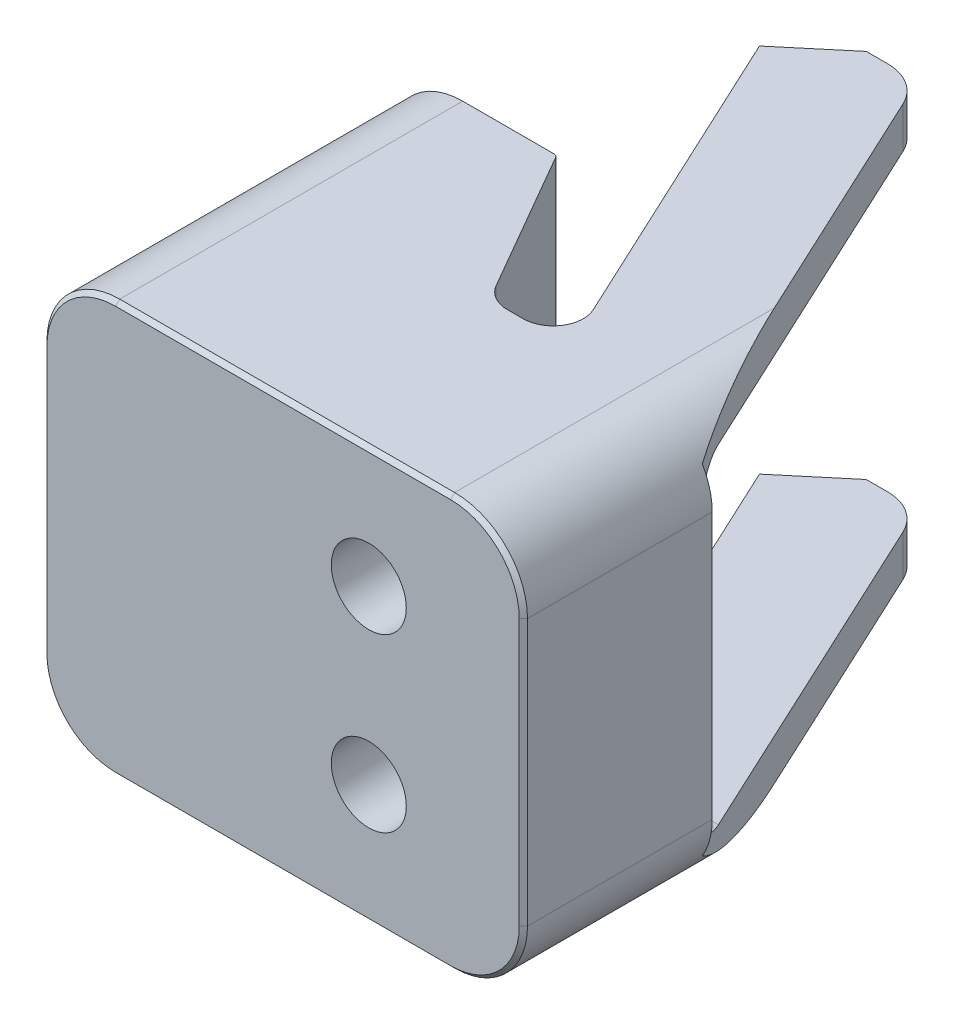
ISO-10303-21;
HEADER;
FILE_DESCRIPTION(('STEP AP214'),'2;1');
FILE_NAME('part.step','',(''),(''),'','','');
FILE_SCHEMA(('AUTOMOTIVE_DESIGN { 1 0 10303 214 1 1 1 1 }'));
ENDSEC;
DATA;
#1=APPLICATION_CONTEXT('core data for automotive mechanical design processes');
#2=APPLICATION_PROTOCOL_DEFINITION('international standard','automotive_design',2000,#1);
#3=PRODUCT_CONTEXT('',#1,'mechanical');
#4=PRODUCT('Part','Part','',(#3));
#5=PRODUCT_RELATED_PRODUCT_CATEGORY('part','',(#4));
#6=PRODUCT_DEFINITION_FORMATION('','',#4);
#7=PRODUCT_DEFINITION_CONTEXT('part definition',#1,'design');
#8=PRODUCT_DEFINITION('design','',#6,#7);
#9=PRODUCT_DEFINITION_SHAPE('','',#8);
#10=(LENGTH_UNIT() NAMED_UNIT(*) SI_UNIT(.MILLI.,.METRE.));
#11=(NAMED_UNIT(*) PLANE_ANGLE_UNIT() SI_UNIT($,.RADIAN.));
#12=(NAMED_UNIT(*) SI_UNIT($,.STERADIAN.) SOLID_ANGLE_UNIT());
#13=UNCERTAINTY_MEASURE_WITH_UNIT(LENGTH_MEASURE(1.E-05),#10,'distance_accuracy_value','');
#14=(GEOMETRIC_REPRESENTATION_CONTEXT(3) GLOBAL_UNCERTAINTY_ASSIGNED_CONTEXT((#13)) GLOBAL_UNIT_ASSIGNED_CONTEXT((#10,
#11,#12)) REPRESENTATION_CONTEXT('',''));
#15=CARTESIAN_POINT('',(0.,0.,0.));
#16=DIRECTION('',(0.,0.,1.));
#17=DIRECTION('',(1.,0.,0.));
#18=AXIS2_PLACEMENT_3D('',#15,#16,#17);
#19=CARTESIAN_POINT('',(-88.8746,-38.0873,0.));
#20=DIRECTION('',(0.,0.,1.));
#21=DIRECTION('',(1.,0.,0.));
#22=AXIS2_PLACEMENT_3D('',#19,#20,#21);
#23=PLANE('',#22);
#24=CARTESIAN_POINT('',(-28.5877,-15.875,0.));
#25=DIRECTION('',(0.,0.,1.));
#26=DIRECTION('',(1.,0.,0.));
#27=AXIS2_PLACEMENT_3D('',#24,#25,#26);
#28=CIRCLE('',#27,6.9342);
#29=CARTESIAN_POINT('',(-21.6535,-15.875,0.));
#30=VERTEX_POINT('',#29);
#31=EDGE_CURVE('E322',#30,#30,#28,.F.);
#32=ORIENTED_EDGE('',*,*,#31,.T.);
#33=EDGE_LOOP('',(#32));
#34=FACE_BOUND('',#33,.T.);
#35=DIRECTION('',(0.,-1.,0.));
#36=VECTOR('',#35,1.);
#37=CARTESIAN_POINT('',(-88.1126,-38.0873,0.));
#38=LINE('',#37,#36);
#39=CARTESIAN_POINT('',(-88.1126,24.6253,0.));
#40=VERTEX_POINT('',#39);
#41=CARTESIAN_POINT('',(-88.1126,-24.6253,0.));
#42=VERTEX_POINT('',#41);
#43=EDGE_CURVE('E633',#40,#42,#38,.T.);
#44=ORIENTED_EDGE('',*,*,#43,.T.);
#45=CARTESIAN_POINT('',(-75.4126,-24.6253,0.));
#46=DIRECTION('',(0.,0.,1.));
#47=DIRECTION('',(1.,0.,0.));
#48=AXIS2_PLACEMENT_3D('',#45,#46,#47);
#49=CIRCLE('',#48,12.7);
#50=CARTESIAN_POINT('',(-75.4126,-37.3253,0.));
#51=VERTEX_POINT('',#50);
#52=EDGE_CURVE('E643',#42,#51,#49,.T.);
#53=ORIENTED_EDGE('',*,*,#52,.T.);
#54=DIRECTION('',(1.,0.,0.));
#55=VECTOR('',#54,1.);
#56=CARTESIAN_POINT('',(-88.8746,-37.3253,0.));
#57=LINE('',#56,#55);
#58=CARTESIAN_POINT('',(-13.462,-37.3253,0.));
#59=VERTEX_POINT('',#58);
#60=EDGE_CURVE('E641',#51,#59,#57,.T.);
#61=ORIENTED_EDGE('',*,*,#60,.T.);
#62=CARTESIAN_POINT('',(-13.462,-24.6253,0.));
#63=DIRECTION('',(0.,0.,1.));
#64=DIRECTION('',(1.,0.,0.));
#65=AXIS2_PLACEMENT_3D('',#62,#63,#64);
#66=CIRCLE('',#65,12.7);
#67=CARTESIAN_POINT('',(-0.762000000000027,-24.6253,0.));
#68=VERTEX_POINT('',#67);
#69=EDGE_CURVE('E639',#59,#68,#66,.T.);
#70=ORIENTED_EDGE('',*,*,#69,.T.);
#71=DIRECTION('',(0.,1.,0.));
#72=VECTOR('',#71,1.);
#73=CARTESIAN_POINT('',(-0.762000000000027,24.6253,0.));
#74=LINE('',#73,#72);
#75=CARTESIAN_POINT('',(-0.762000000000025,24.6253,0.));
#76=VERTEX_POINT('',#75);
#77=EDGE_CURVE('E637',#68,#76,#74,.T.);
#78=ORIENTED_EDGE('',*,*,#77,.T.);
#79=CARTESIAN_POINT('',(-13.462,24.6253,0.));
#80=DIRECTION('',(0.,0.,1.));
#81=DIRECTION('',(1.,0.,0.));
#82=AXIS2_PLACEMENT_3D('',#79,#80,#81);
#83=CIRCLE('',#82,12.7);
#84=CARTESIAN_POINT('',(-13.462,37.3253,0.));
#85=VERTEX_POINT('',#84);
#86=EDGE_CURVE('E635',#76,#85,#83,.T.);
#87=ORIENTED_EDGE('',*,*,#86,.T.);
#88=DIRECTION('',(-1.,0.,0.));
#89=VECTOR('',#88,1.);
#90=CARTESIAN_POINT('',(-88.8746,37.3253,0.));
#91=LINE('',#90,#89);
#92=CARTESIAN_POINT('',(-75.4126,37.3253,0.));
#93=VERTEX_POINT('',#92);
#94=EDGE_CURVE('E629',#85,#93,#91,.T.);
#95=ORIENTED_EDGE('',*,*,#94,.T.);
#96=CARTESIAN_POINT('',(-75.4126,24.6253,0.));
#97=DIRECTION('',(0.,0.,1.));
#98=DIRECTION('',(1.,0.,0.));
#99=AXIS2_PLACEMENT_3D('',#96,#97,#98);
#100=CIRCLE('',#99,12.7);
#101=EDGE_CURVE('E631',#93,#40,#100,.T.);
#102=ORIENTED_EDGE('',*,*,#101,.T.);
#103=EDGE_LOOP('',(#44,#53,#61,#70,#78,#87,#95,#102));
#104=FACE_BOUND('',#103,.T.);
#105=CARTESIAN_POINT('',(-28.5877,15.875,0.));
#106=DIRECTION('',(0.,0.,1.));
#107=DIRECTION('',(1.,0.,0.));
#108=AXIS2_PLACEMENT_3D('',#105,#106,#107);
#109=CIRCLE('',#108,6.9342);
#110=CARTESIAN_POINT('',(-21.6535,15.875,0.));
#111=VERTEX_POINT('',#110);
#112=EDGE_CURVE('E365',#111,#111,#109,.F.);
#113=ORIENTED_EDGE('',*,*,#112,.T.);
#114=EDGE_LOOP('',(#113));
#115=FACE_BOUND('',#114,.T.);
#116=ADVANCED_FACE('F34',(#34,#104,#115),#23,.T.);
#117=CARTESIAN_POINT('',(0.,-63.5,-34.925));
#118=DIRECTION('',(0.,0.,1.));
#119=DIRECTION('',(1.,0.,0.));
#120=AXIS2_PLACEMENT_3D('',#117,#118,#119);
#121=PLANE('',#120);
#122=CARTESIAN_POINT('',(-28.5877,15.875,-34.925));
#123=DIRECTION('',(0.,0.,1.));
#124=DIRECTION('',(1.,0.,0.));
#125=AXIS2_PLACEMENT_3D('',#122,#123,#124);
#126=CIRCLE('',#125,9.9187);
#127=CARTESIAN_POINT('',(-37.931755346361,19.2020466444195,-34.925));
#128=VERTEX_POINT('',#127);
#129=CARTESIAN_POINT('',(-32.6639252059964,24.9174,-34.925));
#130=VERTEX_POINT('',#129);
#131=EDGE_CURVE('E271',#128,#130,#126,.F.);
#132=ORIENTED_EDGE('',*,*,#131,.F.);
#133=DIRECTION('',(0.,1.,0.));
#134=VECTOR('',#133,1.);
#135=CARTESIAN_POINT('',(-37.931755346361,38.0873,-34.925));
#136=LINE('',#135,#134);
#137=CARTESIAN_POINT('',(-37.931755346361,38.0873,-34.925));
#138=VERTEX_POINT('',#137);
#139=EDGE_CURVE('E526',#128,#138,#136,.T.);
#140=ORIENTED_EDGE('',*,*,#139,.T.);
#141=DIRECTION('',(1.,0.,0.));
#142=VECTOR('',#141,1.);
#143=CARTESIAN_POINT('',(-88.8746,38.0873,-34.925));
#144=LINE('',#143,#142);
#145=CARTESIAN_POINT('',(-34.966390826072,38.0873,-34.925));
#146=VERTEX_POINT('',#145);
#147=EDGE_CURVE('E666',#138,#146,#144,.T.);
#148=ORIENTED_EDGE('',*,*,#147,.T.);
#149=DIRECTION('',(0.,1.,0.));
#150=VECTOR('',#149,1.);
#151=CARTESIAN_POINT('',(-34.966390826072,-38.0873,-34.925));
#152=LINE('',#151,#150);
#153=CARTESIAN_POINT('',(-34.966390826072,24.9174,-34.925));
#154=VERTEX_POINT('',#153);
#155=EDGE_CURVE('E519',#146,#154,#152,.F.);
#156=ORIENTED_EDGE('',*,*,#155,.T.);
#157=DIRECTION('',(1.,0.,0.));
#158=VECTOR('',#157,1.);
#159=CARTESIAN_POINT('',(-1.82438678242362,24.9174,-34.925));
#160=LINE('',#159,#158);
#161=EDGE_CURVE('E293',#154,#130,#160,.T.);
#162=ORIENTED_EDGE('',*,*,#161,.T.);
#163=EDGE_LOOP('',(#132,#140,#148,#156,#162));
#164=FACE_BOUND('',#163,.T.);
#165=ADVANCED_FACE('F389',(#164),#121,.F.);
#166=CARTESIAN_POINT('',(-24.5114747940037,24.9174,-34.925));
#167=VERTEX_POINT('',#166);
#168=CARTESIAN_POINT('',(-37.931755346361,12.5479533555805,-34.925));
#169=VERTEX_POINT('',#168);
#170=EDGE_CURVE('E268',#167,#169,#126,.F.);
#171=ORIENTED_EDGE('',*,*,#170,.F.);
#172=CARTESIAN_POINT('',(-1.82438678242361,24.9174,-34.925));
#173=VERTEX_POINT('',#172);
#174=EDGE_CURVE('E282',#167,#173,#160,.T.);
#175=ORIENTED_EDGE('',*,*,#174,.T.);
#176=DIRECTION('',(0.,1.,0.));
#177=VECTOR('',#176,1.);
#178=CARTESIAN_POINT('',(-1.82438678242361,-63.5,-34.925));
#179=LINE('',#178,#177);
#180=CARTESIAN_POINT('',(-1.82438678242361,31.3922345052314,-34.925));
#181=VERTEX_POINT('',#180);
#182=EDGE_CURVE('E592',#173,#181,#179,.T.);
#183=ORIENTED_EDGE('',*,*,#182,.T.);
#184=CARTESIAN_POINT('',(-13.462,24.6253,-34.925));
#185=DIRECTION('',(0.,0.,1.));
#186=DIRECTION('',(1.,0.,0.));
#187=AXIS2_PLACEMENT_3D('',#184,#185,#186);
#188=CIRCLE('',#187,13.462);
#189=CARTESIAN_POINT('',(0.,24.6253,-34.925));
#190=VERTEX_POINT('',#189);
#191=EDGE_CURVE('E627',#181,#190,#188,.F.);
#192=ORIENTED_EDGE('',*,*,#191,.T.);
#193=DIRECTION('',(0.,1.,0.));
#194=VECTOR('',#193,1.);
#195=CARTESIAN_POINT('',(0.,38.0873,-34.925));
#196=LINE('',#195,#194);
#197=CARTESIAN_POINT('',(0.,-24.6253,-34.925));
#198=VERTEX_POINT('',#197);
#199=EDGE_CURVE('E596',#198,#190,#196,.T.);
#200=ORIENTED_EDGE('',*,*,#199,.F.);
#201=CARTESIAN_POINT('',(-13.462,-24.6253,-34.925));
#202=DIRECTION('',(0.,0.,1.));
#203=DIRECTION('',(1.,0.,0.));
#204=AXIS2_PLACEMENT_3D('',#201,#202,#203);
#205=CIRCLE('',#204,13.462);
#206=CARTESIAN_POINT('',(-1.82438678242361,-31.3922345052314,-34.925));
#207=VERTEX_POINT('',#206);
#208=EDGE_CURVE('E625',#198,#207,#205,.F.);
#209=ORIENTED_EDGE('',*,*,#208,.T.);
#210=CARTESIAN_POINT('',(-1.82438678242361,-24.9174,-34.925));
#211=VERTEX_POINT('',#210);
#212=EDGE_CURVE('E588',#207,#211,#179,.T.);
#213=ORIENTED_EDGE('',*,*,#212,.T.);
#214=DIRECTION('',(1.,0.,0.));
#215=VECTOR('',#214,1.);
#216=CARTESIAN_POINT('',(-34.966390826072,-24.9174,-34.925));
#217=LINE('',#216,#215);
#218=CARTESIAN_POINT('',(-24.5114747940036,-24.9174,-34.925));
#219=VERTEX_POINT('',#218);
#220=EDGE_CURVE('E302',#211,#219,#217,.F.);
#221=ORIENTED_EDGE('',*,*,#220,.T.);
#222=CARTESIAN_POINT('',(-28.5877,-15.875,-34.925));
#223=DIRECTION('',(0.,0.,1.));
#224=DIRECTION('',(1.,0.,0.));
#225=AXIS2_PLACEMENT_3D('',#222,#223,#224);
#226=CIRCLE('',#225,9.9187);
#227=CARTESIAN_POINT('',(-37.931755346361,-12.5479533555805,-34.925));
#228=VERTEX_POINT('',#227);
#229=EDGE_CURVE('E346',#228,#219,#226,.F.);
#230=ORIENTED_EDGE('',*,*,#229,.F.);
#231=EDGE_CURVE('E286',#228,#169,#136,.T.);
#232=ORIENTED_EDGE('',*,*,#231,.T.);
#233=EDGE_LOOP('',(#171,#175,#183,#192,#200,#209,#213,#221,#230,#232));
#234=FACE_BOUND('',#233,.T.);
#235=ADVANCED_FACE('F281',(#234),#121,.F.);
#236=CARTESIAN_POINT('',(-37.931755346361,-63.5,-40.4876));
#237=DIRECTION('',(0.,-1.,0.));
#238=DIRECTION('',(0.,0.,-1.));
#239=AXIS2_PLACEMENT_3D('',#236,#237,#238);
#240=CYLINDRICAL_SURFACE('',#239,5.5626);
#241=CARTESIAN_POINT('',(-37.931755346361,12.5479533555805,-34.925));
#242=CARTESIAN_POINT('',(-37.9711195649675,12.6585082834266,-34.9250029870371));
#243=CARTESIAN_POINT('',(-38.0085177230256,12.7697512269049,-34.9254174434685));
#244=CARTESIAN_POINT('',(-38.079342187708,12.9934884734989,-34.926844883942));
#245=CARTESIAN_POINT('',(-38.1127685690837,13.10598275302,-34.9278578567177));
#246=CARTESIAN_POINT('',(-38.2070171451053,13.4451063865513,-34.9314573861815));
#247=CARTESIAN_POINT('',(-38.2618281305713,13.6734309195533,-34.9346047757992));
#248=CARTESIAN_POINT('',(-38.3552197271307,14.133883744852,-34.9409440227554));
#249=CARTESIAN_POINT('',(-38.3937639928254,14.3660193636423,-34.9441359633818));
#250=CARTESIAN_POINT('',(-38.4542621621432,14.8324675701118,-34.9495116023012));
#251=CARTESIAN_POINT('',(-38.4762150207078,15.0667802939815,-34.9516952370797));
#252=CARTESIAN_POINT('',(-38.505925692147,15.5798831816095,-34.9546855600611));
#253=CARTESIAN_POINT('',(-38.5103034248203,15.8588772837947,-34.9551625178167));
#254=CARTESIAN_POINT('',(-38.4955434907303,16.4163025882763,-34.9536404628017));
#255=CARTESIAN_POINT('',(-38.4763994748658,16.6947336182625,-34.9516407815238));
#256=CARTESIAN_POINT('',(-38.4147994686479,17.248371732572,-34.9459271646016));
#257=CARTESIAN_POINT('',(-38.3723933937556,17.5235844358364,-34.9422169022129));
#258=CARTESIAN_POINT('',(-38.2646183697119,18.0693449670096,-34.9347052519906));
#259=CARTESIAN_POINT('',(-38.1992636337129,18.3398955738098,-34.9309039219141));
#260=CARTESIAN_POINT('',(-38.0939812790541,18.7073309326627,-34.9272932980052));
#261=CARTESIAN_POINT('',(-38.0637006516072,18.8070445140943,-34.9264740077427));
#262=CARTESIAN_POINT('',(-38.0000453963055,19.0053660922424,-34.9253280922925));
#263=CARTESIAN_POINT('',(-37.9666740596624,19.1039751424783,-34.9250009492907));
#264=CARTESIAN_POINT('',(-37.931755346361,19.2020466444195,-34.925));
#265=B_SPLINE_CURVE_WITH_KNOTS('',3,(#241,#242,#243,#244,#245,#246,#247,#248,#249,#250,#251,
#252,#253,#254,#255,#256,#257,#258,#259,#260,#261,#262,#263,#264),.UNSPECIFIED.,.F.,.F.,(4,2,2,
2,2,2,2,2,2,2,2,4),(0.,0.352020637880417,0.704034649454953,1.40788989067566,2.11330956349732,
2.81877366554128,3.65483270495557,4.49111746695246,5.32561471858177,6.15959603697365,
6.47219460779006,6.7844640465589),.UNSPECIFIED.);
#266=EDGE_CURVE('E359',#169,#128,#265,.T.);
#267=ORIENTED_EDGE('',*,*,#266,.F.);
#268=ORIENTED_EDGE('',*,*,#231,.F.);
#269=CARTESIAN_POINT('',(-37.931755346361,-19.2020466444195,-34.925));
#270=CARTESIAN_POINT('',(-37.9711195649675,-19.0914917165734,-34.9250029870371));
#271=CARTESIAN_POINT('',(-38.0085177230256,-18.9802487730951,-34.9254174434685));
#272=CARTESIAN_POINT('',(-38.079342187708,-18.7565115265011,-34.926844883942));
#273=CARTESIAN_POINT('',(-38.1127685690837,-18.64401724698,-34.9278578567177));
#274=CARTESIAN_POINT('',(-38.2070171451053,-18.3048936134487,-34.9314573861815));
#275=CARTESIAN_POINT('',(-38.2618281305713,-18.0765690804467,-34.9346047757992));
#276=CARTESIAN_POINT('',(-38.3552197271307,-17.616116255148,-34.9409440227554));
#277=CARTESIAN_POINT('',(-38.3937639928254,-17.3839806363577,-34.9441359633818));
#278=CARTESIAN_POINT('',(-38.4542621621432,-16.9175324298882,-34.9495116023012));
#279=CARTESIAN_POINT('',(-38.4762150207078,-16.6832197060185,-34.9516952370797));
#280=CARTESIAN_POINT('',(-38.505925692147,-16.1701168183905,-34.9546855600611));
#281=CARTESIAN_POINT('',(-38.5103034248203,-15.8911227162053,-34.9551625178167));
#282=CARTESIAN_POINT('',(-38.4955434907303,-15.3336974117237,-34.9536404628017));
#283=CARTESIAN_POINT('',(-38.4763994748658,-15.0552663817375,-34.9516407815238));
#284=CARTESIAN_POINT('',(-38.4147994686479,-14.501628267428,-34.9459271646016));
#285=CARTESIAN_POINT('',(-38.3723933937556,-14.2264155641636,-34.9422169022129));
#286=CARTESIAN_POINT('',(-38.2646183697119,-13.6806550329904,-34.9347052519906));
#287=CARTESIAN_POINT('',(-38.1992636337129,-13.4101044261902,-34.9309039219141));
#288=CARTESIAN_POINT('',(-38.0939812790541,-13.0426690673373,-34.9272932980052));
#289=CARTESIAN_POINT('',(-38.0637006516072,-12.9429554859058,-34.9264740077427));
#290=CARTESIAN_POINT('',(-38.0000453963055,-12.7446339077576,-34.9253280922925));
#291=CARTESIAN_POINT('',(-37.9666740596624,-12.6460248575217,-34.9250009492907));
#292=CARTESIAN_POINT('',(-37.931755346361,-12.5479533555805,-34.925));
#293=B_SPLINE_CURVE_WITH_KNOTS('',3,(#269,#270,#271,#272,#273,#274,#275,#276,#277,#278,#279,
#280,#281,#282,#283,#284,#285,#286,#287,#288,#289,#290,#291,#292),.UNSPECIFIED.,.F.,.F.,(4,2,2,
2,2,2,2,2,2,2,2,4),(0.,0.352020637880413,0.70403464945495,1.40788989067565,2.11330956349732,
2.81877366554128,3.65483270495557,4.49111746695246,5.32561471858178,6.15959603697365,
6.47219460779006,6.7844640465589),.UNSPECIFIED.);
#294=CARTESIAN_POINT('',(-37.931755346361,-19.2020466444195,-34.925));
#295=VERTEX_POINT('',#294);
#296=EDGE_CURVE('E339',#295,#228,#293,.T.);
#297=ORIENTED_EDGE('',*,*,#296,.F.);
#298=CARTESIAN_POINT('',(-37.931755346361,-38.0873,-34.925));
#299=VERTEX_POINT('',#298);
#300=EDGE_CURVE('E527',#299,#295,#136,.T.);
#301=ORIENTED_EDGE('',*,*,#300,.F.);
#302=CARTESIAN_POINT('',(-37.931755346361,-38.0873,-40.4876));
#303=DIRECTION('',(0.,-1.,0.));
#304=DIRECTION('',(0.,0.,-1.));
#305=AXIS2_PLACEMENT_3D('',#302,#303,#304);
#306=CIRCLE('',#305,5.5626);
#307=CARTESIAN_POINT('',(-42.7491082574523,-38.0873,-37.7063));
#308=VERTEX_POINT('',#307);
#309=EDGE_CURVE('E535',#308,#299,#306,.F.);
#310=ORIENTED_EDGE('',*,*,#309,.F.);
#311=DIRECTION('',(0.,1.,0.));
#312=VECTOR('',#311,1.);
#313=CARTESIAN_POINT('',(-42.7491082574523,-38.0873,-37.7063));
#314=LINE('',#313,#312);
#315=CARTESIAN_POINT('',(-42.7491082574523,38.0873,-37.7063));
#316=VERTEX_POINT('',#315);
#317=EDGE_CURVE('E530',#316,#308,#314,.F.);
#318=ORIENTED_EDGE('',*,*,#317,.F.);
#319=CARTESIAN_POINT('',(-37.931755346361,38.0873,-40.4876));
#320=DIRECTION('',(0.,1.,0.));
#321=DIRECTION('',(0.,0.,1.));
#322=AXIS2_PLACEMENT_3D('',#319,#320,#321);
#323=CIRCLE('',#322,5.5626);
#324=EDGE_CURVE('E532',#138,#316,#323,.F.);
#325=ORIENTED_EDGE('',*,*,#324,.F.);
#326=ORIENTED_EDGE('',*,*,#139,.F.);
#327=EDGE_LOOP('',(#267,#268,#297,#301,#310,#318,#325,#326));
#328=FACE_BOUND('',#327,.T.);
#329=ADVANCED_FACE('F350',(#328),#240,.F.);
#330=CARTESIAN_POINT('',(0.,24.9174,-40.4876));
#331=DIRECTION('',(-1.,0.,0.));
#332=DIRECTION('',(0.,0.,1.));
#333=AXIS2_PLACEMENT_3D('',#330,#331,#332);
#334=CYLINDRICAL_SURFACE('',#333,5.5626);
#335=CARTESIAN_POINT('',(-32.6639252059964,24.9174,-34.925));
#336=CARTESIAN_POINT('',(-32.5568184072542,24.9656827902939,-34.9250027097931));
#337=CARTESIAN_POINT('',(-32.448865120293,25.0120570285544,-34.9256282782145));
#338=CARTESIAN_POINT('',(-32.2313920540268,25.1009372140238,-34.9278504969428));
#339=CARTESIAN_POINT('',(-32.1218723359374,25.1434433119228,-34.9294471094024));
#340=CARTESIAN_POINT('',(-31.7912156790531,25.2650604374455,-34.9352803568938));
#341=CARTESIAN_POINT('',(-31.5679081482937,25.338303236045,-34.9405607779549));
#342=CARTESIAN_POINT('',(-31.1166004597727,25.4687731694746,-34.9520062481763));
#343=CARTESIAN_POINT('',(-30.888598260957,25.5259931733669,-34.9581716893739));
#344=CARTESIAN_POINT('',(-30.4290661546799,25.6241120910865,-34.9698545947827));
#345=CARTESIAN_POINT('',(-30.1975358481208,25.6650091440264,-34.9753719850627));
#346=CARTESIAN_POINT('',(-29.6898508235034,25.7361837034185,-34.9854494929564));
#347=CARTESIAN_POINT('',(-29.4132234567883,25.7631868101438,-34.9896541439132));
#348=CARTESIAN_POINT('',(-28.8586135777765,25.7938893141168,-34.994465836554));
#349=CARTESIAN_POINT('',(-28.5806308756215,25.7975853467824,-34.9950723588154));
#350=CARTESIAN_POINT('',(-28.0254746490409,25.7816441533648,-34.992541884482));
#351=CARTESIAN_POINT('',(-27.748300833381,25.7620167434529,-34.9894064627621));
#352=CARTESIAN_POINT('',(-27.1966676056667,25.699594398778,-34.9801785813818));
#353=CARTESIAN_POINT('',(-26.9222076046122,25.6568046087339,-34.9740867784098));
#354=CARTESIAN_POINT('',(-26.46604209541,25.5659449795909,-34.9628156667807));
#355=CARTESIAN_POINT('',(-26.2830687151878,25.5240672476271,-34.9579792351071));
#356=CARTESIAN_POINT('',(-25.9198177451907,25.4300090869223,-34.9484676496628));
#357=CARTESIAN_POINT('',(-25.7395395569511,25.3778309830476,-34.9437924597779));
#358=CARTESIAN_POINT('',(-25.3824026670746,25.2633862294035,-34.9354728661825));
#359=CARTESIAN_POINT('',(-25.2055405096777,25.2011304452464,-34.9318273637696));
#360=CARTESIAN_POINT('',(-24.8555512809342,25.0666733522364,-34.9266022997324));
#361=CARTESIAN_POINT('',(-24.682425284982,24.9944692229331,-34.925023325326));
#362=CARTESIAN_POINT('',(-24.5114747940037,24.9174,-34.925));
#363=B_SPLINE_CURVE_WITH_KNOTS('',3,(#335,#336,#337,#338,#339,#340,#341,#342,#343,#344,#345,
#346,#347,#348,#349,#350,#351,#352,#353,#354,#355,#356,#357,#358,#359,#360,#361,#362),
.UNSPECIFIED.,.F.,.F.,(4,2,2,2,2,2,2,2,2,2,2,2,2,4),(0.,0.352415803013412,0.704817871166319,
1.40938206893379,2.11425933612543,2.81921693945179,3.65211634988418,4.48513599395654,
5.31780516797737,6.15028946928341,6.7133145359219,7.27621266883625,7.83850788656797,
8.40096284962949),.UNSPECIFIED.);
#364=EDGE_CURVE('E265',#130,#167,#363,.T.);
#365=ORIENTED_EDGE('',*,*,#364,.F.);
#366=ORIENTED_EDGE('',*,*,#161,.F.);
#367=CARTESIAN_POINT('',(-34.966390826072,24.9174,-40.4876));
#368=DIRECTION('',(0.707106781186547,-0.707106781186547,0.));
#369=DIRECTION('',(-0.707106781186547,-0.707106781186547,0.));
#370=AXIS2_PLACEMENT_3D('',#367,#368,#369);
#371=ELLIPSE('',#370,7.86670436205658,5.5626);
#372=CARTESIAN_POINT('',(-29.403790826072,30.48,-40.4876));
#373=VERTEX_POINT('',#372);
#374=EDGE_CURVE('E313',#373,#154,#371,.T.);
#375=ORIENTED_EDGE('',*,*,#374,.F.);
#376=DIRECTION('',(1.,0.,0.));
#377=VECTOR('',#376,1.);
#378=CARTESIAN_POINT('',(-34.966390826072,30.48,-40.4876));
#379=LINE('',#378,#377);
#380=CARTESIAN_POINT('',(-4.41826976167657,30.48,-40.4876));
#381=VERTEX_POINT('',#380);
#382=EDGE_CURVE('E305',#381,#373,#379,.F.);
#383=ORIENTED_EDGE('',*,*,#382,.F.);
#384=CARTESIAN_POINT('',(-4.41826976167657,24.9174,-40.4876));
#385=DIRECTION('',(-0.906307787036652,0.,0.422618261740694));
#386=DIRECTION('',(-0.422618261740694,0.,-0.906307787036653));
#387=AXIS2_PLACEMENT_3D('',#384,#385,#386);
#388=ELLIPSE('',#387,6.13765001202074,5.5626);
#389=EDGE_CURVE('E292',#173,#381,#388,.T.);
#390=ORIENTED_EDGE('',*,*,#389,.F.);
#391=ORIENTED_EDGE('',*,*,#174,.F.);
#392=EDGE_LOOP('',(#365,#366,#375,#383,#390,#391));
#393=FACE_BOUND('',#392,.T.);
#394=ADVANCED_FACE('F290',(#393),#334,.F.);
#395=CARTESIAN_POINT('',(-32.6639252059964,-24.9174,-34.925));
#396=VERTEX_POINT('',#395);
#397=EDGE_CURVE('E345',#396,#295,#226,.F.);
#398=ORIENTED_EDGE('',*,*,#397,.F.);
#399=CARTESIAN_POINT('',(-34.966390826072,-24.9174,-34.925));
#400=VERTEX_POINT('',#399);
#401=EDGE_CURVE('E296',#396,#400,#217,.F.);
#402=ORIENTED_EDGE('',*,*,#401,.T.);
#403=CARTESIAN_POINT('',(-34.966390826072,-38.0873,-34.925));
#404=VERTEX_POINT('',#403);
#405=EDGE_CURVE('E518',#400,#404,#152,.F.);
#406=ORIENTED_EDGE('',*,*,#405,.T.);
#407=DIRECTION('',(-1.,0.,0.));
#408=VECTOR('',#407,1.);
#409=CARTESIAN_POINT('',(-88.8746,-38.0873,-34.925));
#410=LINE('',#409,#408);
#411=EDGE_CURVE('E564',#404,#299,#410,.T.);
#412=ORIENTED_EDGE('',*,*,#411,.T.);
#413=ORIENTED_EDGE('',*,*,#300,.T.);
#414=EDGE_LOOP('',(#398,#402,#406,#412,#413));
#415=FACE_BOUND('',#414,.T.);
#416=ADVANCED_FACE('F383',(#415),#121,.F.);
#417=CARTESIAN_POINT('',(-36.83,-24.9174,-40.4876));
#418=DIRECTION('',(-1.,0.,0.));
#419=DIRECTION('',(0.,0.,1.));
#420=AXIS2_PLACEMENT_3D('',#417,#418,#419);
#421=CYLINDRICAL_SURFACE('',#420,5.5626);
#422=CARTESIAN_POINT('',(-24.5114747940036,-24.9174,-34.925));
#423=CARTESIAN_POINT('',(-24.6185815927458,-24.9656827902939,-34.9250027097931));
#424=CARTESIAN_POINT('',(-24.726534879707,-25.0120570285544,-34.9256282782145));
#425=CARTESIAN_POINT('',(-24.9440079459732,-25.1009372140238,-34.9278504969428));
#426=CARTESIAN_POINT('',(-25.0535276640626,-25.1434433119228,-34.9294471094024));
#427=CARTESIAN_POINT('',(-25.3841843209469,-25.2650604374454,-34.9352803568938));
#428=CARTESIAN_POINT('',(-25.6074918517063,-25.338303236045,-34.9405607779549));
#429=CARTESIAN_POINT('',(-26.0587995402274,-25.4687731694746,-34.9520062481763));
#430=CARTESIAN_POINT('',(-26.286801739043,-25.5259931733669,-34.9581716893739));
#431=CARTESIAN_POINT('',(-26.7463338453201,-25.6241120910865,-34.9698545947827));
#432=CARTESIAN_POINT('',(-26.9778641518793,-25.6650091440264,-34.9753719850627));
#433=CARTESIAN_POINT('',(-27.4855491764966,-25.7361837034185,-34.9854494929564));
#434=CARTESIAN_POINT('',(-27.7621765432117,-25.7631868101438,-34.9896541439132));
#435=CARTESIAN_POINT('',(-28.3167864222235,-25.7938893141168,-34.994465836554));
#436=CARTESIAN_POINT('',(-28.5947691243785,-25.7975853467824,-34.9950723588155));
#437=CARTESIAN_POINT('',(-29.1499253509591,-25.7816441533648,-34.992541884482));
#438=CARTESIAN_POINT('',(-29.427099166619,-25.7620167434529,-34.9894064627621));
#439=CARTESIAN_POINT('',(-29.9787323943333,-25.699594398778,-34.9801785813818));
#440=CARTESIAN_POINT('',(-30.2531923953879,-25.6568046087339,-34.9740867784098));
#441=CARTESIAN_POINT('',(-30.70935790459,-25.5659449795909,-34.9628156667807));
#442=CARTESIAN_POINT('',(-30.8923312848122,-25.5240672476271,-34.9579792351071));
#443=CARTESIAN_POINT('',(-31.2555822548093,-25.4300090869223,-34.9484676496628));
#444=CARTESIAN_POINT('',(-31.4358604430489,-25.3778309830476,-34.9437924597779));
#445=CARTESIAN_POINT('',(-31.7929973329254,-25.2633862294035,-34.9354728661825));
#446=CARTESIAN_POINT('',(-31.9698594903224,-25.2011304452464,-34.9318273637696));
#447=CARTESIAN_POINT('',(-32.3198487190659,-25.0666733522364,-34.9266022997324));
#448=CARTESIAN_POINT('',(-32.4929747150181,-24.9944692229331,-34.925023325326));
#449=CARTESIAN_POINT('',(-32.6639252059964,-24.9174,-34.925));
#450=B_SPLINE_CURVE_WITH_KNOTS('',3,(#422,#423,#424,#425,#426,#427,#428,#429,#430,#431,#432,
#433,#434,#435,#436,#437,#438,#439,#440,#441,#442,#443,#444,#445,#446,#447,#448,#449),
.UNSPECIFIED.,.F.,.F.,(4,2,2,2,2,2,2,2,2,2,2,2,2,4),(0.,0.352415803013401,0.704817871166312,
1.40938206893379,2.11425933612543,2.81921693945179,3.65211634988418,4.48513599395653,
5.31780516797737,6.15028946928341,6.7133145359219,7.27621266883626,7.83850788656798,
8.4009628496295),.UNSPECIFIED.);
#451=EDGE_CURVE('E277',#219,#396,#450,.T.);
#452=ORIENTED_EDGE('',*,*,#451,.F.);
#453=ORIENTED_EDGE('',*,*,#220,.F.);
#454=CARTESIAN_POINT('',(-4.41826976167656,-24.9174,-40.4876));
#455=DIRECTION('',(-0.906307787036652,0.,0.422618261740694));
#456=DIRECTION('',(-0.422618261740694,0.,-0.906307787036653));
#457=AXIS2_PLACEMENT_3D('',#454,#455,#456);
#458=ELLIPSE('',#457,6.13765001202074,5.5626);
#459=CARTESIAN_POINT('',(-4.41826976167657,-30.48,-40.4876));
#460=VERTEX_POINT('',#459);
#461=EDGE_CURVE('E307',#460,#211,#458,.T.);
#462=ORIENTED_EDGE('',*,*,#461,.F.);
#463=DIRECTION('',(1.,0.,0.));
#464=VECTOR('',#463,1.);
#465=CARTESIAN_POINT('',(-1.82438678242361,-30.48,-40.4876));
#466=LINE('',#465,#464);
#467=CARTESIAN_POINT('',(-29.403790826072,-30.48,-40.4876));
#468=VERTEX_POINT('',#467);
#469=EDGE_CURVE('E294',#468,#460,#466,.T.);
#470=ORIENTED_EDGE('',*,*,#469,.F.);
#471=CARTESIAN_POINT('',(-34.966390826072,-24.9174,-40.4876));
#472=DIRECTION('',(-0.707106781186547,-0.707106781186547,0.));
#473=DIRECTION('',(0.707106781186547,-0.707106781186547,0.));
#474=AXIS2_PLACEMENT_3D('',#471,#472,#473);
#475=ELLIPSE('',#474,7.86670436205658,5.5626);
#476=EDGE_CURVE('E310',#400,#468,#475,.F.);
#477=ORIENTED_EDGE('',*,*,#476,.F.);
#478=ORIENTED_EDGE('',*,*,#401,.F.);
#479=EDGE_LOOP('',(#452,#453,#462,#470,#477,#478));
#480=FACE_BOUND('',#479,.T.);
#481=ADVANCED_FACE('F323',(#480),#421,.F.);
#482=CARTESIAN_POINT('',(-88.8746,38.0873,-109.474));
#483=DIRECTION('',(0.,0.,-1.));
#484=DIRECTION('',(0.,1.,0.));
#485=AXIS2_PLACEMENT_3D('',#482,#483,#484);
#486=PLANE('',#485);
#487=DIRECTION('',(1.,0.,0.));
#488=VECTOR('',#487,1.);
#489=CARTESIAN_POINT('',(-88.8746,30.48,-109.474));
#490=LINE('',#489,#488);
#491=CARTESIAN_POINT('',(-46.0537777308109,30.48,-109.474));
#492=VERTEX_POINT('',#491);
#493=CARTESIAN_POINT('',(-42.0888951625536,30.48,-109.474));
#494=VERTEX_POINT('',#493);
#495=EDGE_CURVE('E494',#492,#494,#490,.T.);
#496=ORIENTED_EDGE('',*,*,#495,.F.);
#497=DIRECTION('',(0.,-1.,0.));
#498=VECTOR('',#497,1.);
#499=CARTESIAN_POINT('',(-46.0537777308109,38.0873,-109.474));
#500=LINE('',#499,#498);
#501=CARTESIAN_POINT('',(-46.0537777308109,38.0873,-109.474));
#502=VERTEX_POINT('',#501);
#503=EDGE_CURVE('E732',#502,#492,#500,.T.);
#504=ORIENTED_EDGE('',*,*,#503,.F.);
#505=DIRECTION('',(1.,0.,0.));
#506=VECTOR('',#505,1.);
#507=CARTESIAN_POINT('',(-88.8746,38.0873,-109.474));
#508=LINE('',#507,#506);
#509=CARTESIAN_POINT('',(-42.0888951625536,38.0873,-109.474));
#510=VERTEX_POINT('',#509);
#511=EDGE_CURVE('E505',#502,#510,#508,.T.);
#512=ORIENTED_EDGE('',*,*,#511,.T.);
#513=DIRECTION('',(0.,1.,0.));
#514=VECTOR('',#513,1.);
#515=CARTESIAN_POINT('',(-42.0888951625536,-38.0873,-109.474));
#516=LINE('',#515,#514);
#517=EDGE_CURVE('E486',#510,#494,#516,.F.);
#518=ORIENTED_EDGE('',*,*,#517,.T.);
#519=EDGE_LOOP('',(#496,#504,#512,#518));
#520=FACE_BOUND('',#519,.T.);
#521=ADVANCED_FACE('F503',(#520),#486,.T.);
#522=CARTESIAN_POINT('',(-56.7948686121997,-63.5,-100.461154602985));
#523=DIRECTION('',(0.642787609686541,0.,0.766044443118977));
#524=DIRECTION('',(0.766044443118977,0.,-0.642787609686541));
#525=AXIS2_PLACEMENT_3D('',#522,#523,#524);
#526=PLANE('',#525);
#527=ORIENTED_EDGE('',*,*,#503,.T.);
#528=DIRECTION('',(-0.766044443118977,0.,0.642787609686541));
#529=VECTOR('',#528,1.);
#530=CARTESIAN_POINT('',(-56.7948686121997,30.48,-100.461154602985));
#531=LINE('',#530,#529);
#532=CARTESIAN_POINT('',(-56.7948686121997,30.48,-100.461154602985));
#533=VERTEX_POINT('',#532);
#534=EDGE_CURVE('E496',#492,#533,#531,.T.);
#535=ORIENTED_EDGE('',*,*,#534,.T.);
#536=DIRECTION('',(0.,1.,0.));
#537=VECTOR('',#536,1.);
#538=CARTESIAN_POINT('',(-56.7948686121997,-63.5,-100.461154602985));
#539=LINE('',#538,#537);
#540=CARTESIAN_POINT('',(-56.7948686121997,38.0873,-100.461154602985));
#541=VERTEX_POINT('',#540);
#542=EDGE_CURVE('E715',#533,#541,#539,.T.);
#543=ORIENTED_EDGE('',*,*,#542,.T.);
#544=DIRECTION('',(0.766044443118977,0.,-0.642787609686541));
#545=VECTOR('',#544,1.);
#546=CARTESIAN_POINT('',(-125.087489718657,38.0873,-43.156841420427));
#547=LINE('',#546,#545);
#548=EDGE_CURVE('E734',#541,#502,#547,.T.);
#549=ORIENTED_EDGE('',*,*,#548,.T.);
#550=EDGE_LOOP('',(#527,#535,#543,#549));
#551=FACE_BOUND('',#550,.T.);
#552=ADVANCED_FACE('F477',(#551),#526,.F.);
#553=CARTESIAN_POINT('',(-26.2348578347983,-63.5,-34.925));
#554=DIRECTION('',(0.906307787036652,0.,-0.422618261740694));
#555=DIRECTION('',(-0.422618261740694,0.,-0.906307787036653));
#556=AXIS2_PLACEMENT_3D('',#553,#554,#555);
#557=PLANE('',#556);
#558=ORIENTED_EDGE('',*,*,#542,.F.);
#559=DIRECTION('',(0.422618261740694,0.,0.906307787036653));
#560=VECTOR('',#559,1.);
#561=CARTESIAN_POINT('',(-26.2348578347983,30.48,-34.925));
#562=LINE('',#561,#560);
#563=CARTESIAN_POINT('',(-29.9249631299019,30.48,-42.8384563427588));
#564=VERTEX_POINT('',#563);
#565=EDGE_CURVE('E491',#533,#564,#562,.T.);
#566=ORIENTED_EDGE('',*,*,#565,.T.);
#567=DIRECTION('',(0.,1.,0.));
#568=VECTOR('',#567,1.);
#569=CARTESIAN_POINT('',(-29.9249631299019,38.0873,-42.8384563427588));
#570=LINE('',#569,#568);
#571=CARTESIAN_POINT('',(-29.924963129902,38.0873,-42.8384563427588));
#572=VERTEX_POINT('',#571);
#573=EDGE_CURVE('E509',#564,#572,#570,.T.);
#574=ORIENTED_EDGE('',*,*,#573,.T.);
#575=DIRECTION('',(-0.422618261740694,0.,-0.906307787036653));
#576=VECTOR('',#575,1.);
#577=CARTESIAN_POINT('',(-24.0456527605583,38.0873,-30.2302345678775));
#578=LINE('',#577,#576);
#579=EDGE_CURVE('E728',#572,#541,#578,.T.);
#580=ORIENTED_EDGE('',*,*,#579,.T.);
#581=EDGE_LOOP('',(#558,#566,#574,#580));
#582=FACE_BOUND('',#581,.T.);
#583=ADVANCED_FACE('F466',(#582),#557,.F.);
#584=CARTESIAN_POINT('',(-42.0888951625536,-63.5,-100.838));
#585=DIRECTION('',(0.,-1.,0.));
#586=DIRECTION('',(0.,0.,-1.));
#587=AXIS2_PLACEMENT_3D('',#584,#585,#586);
#588=CYLINDRICAL_SURFACE('',#587,8.636);
#589=CARTESIAN_POINT('',(-42.0888951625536,30.48,-100.838));
#590=DIRECTION('',(0.,1.,0.));
#591=DIRECTION('',(0.,0.,1.));
#592=AXIS2_PLACEMENT_3D('',#589,#590,#591);
#593=CIRCLE('',#592,8.636);
#594=CARTESIAN_POINT('',(-34.2620211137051,30.48,-104.487731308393));
#595=VERTEX_POINT('',#594);
#596=EDGE_CURVE('E482',#494,#595,#593,.F.);
#597=ORIENTED_EDGE('',*,*,#596,.F.);
#598=ORIENTED_EDGE('',*,*,#517,.F.);
#599=CARTESIAN_POINT('',(-42.0888951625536,38.0873,-100.838));
#600=DIRECTION('',(0.,1.,0.));
#601=DIRECTION('',(0.,0.,1.));
#602=AXIS2_PLACEMENT_3D('',#599,#600,#601);
#603=CIRCLE('',#602,8.636);
#604=CARTESIAN_POINT('',(-34.2620211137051,38.0873,-104.487731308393));
#605=VERTEX_POINT('',#604);
#606=EDGE_CURVE('E511',#605,#510,#603,.T.);
#607=ORIENTED_EDGE('',*,*,#606,.F.);
#608=DIRECTION('',(0.,1.,0.));
#609=VECTOR('',#608,1.);
#610=CARTESIAN_POINT('',(-34.2620211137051,38.0873,-104.487731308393));
#611=LINE('',#610,#609);
#612=EDGE_CURVE('E487',#595,#605,#611,.T.);
#613=ORIENTED_EDGE('',*,*,#612,.F.);
#614=EDGE_LOOP('',(#597,#598,#607,#613));
#615=FACE_BOUND('',#614,.T.);
#616=ADVANCED_FACE('F456',(#615),#588,.T.);
#617=CARTESIAN_POINT('',(-1.82438678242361,-63.5,-34.925));
#618=DIRECTION('',(-0.906307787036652,0.,0.422618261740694));
#619=DIRECTION('',(0.422618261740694,0.,0.906307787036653));
#620=AXIS2_PLACEMENT_3D('',#617,#618,#619);
#621=PLANE('',#620);
#622=CARTESIAN_POINT('',(-34.2620211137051,-38.0873,-104.487731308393));
#623=VERTEX_POINT('',#622);
#624=CARTESIAN_POINT('',(-34.2620211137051,-30.48,-104.487731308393));
#625=VERTEX_POINT('',#624);
#626=EDGE_CURVE('E574',#623,#625,#611,.T.);
#627=ORIENTED_EDGE('',*,*,#626,.T.);
#628=DIRECTION('',(0.422618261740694,0.,0.906307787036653));
#629=VECTOR('',#628,1.);
#630=CARTESIAN_POINT('',(-1.82438678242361,-30.48,-34.925));
#631=LINE('',#630,#629);
#632=EDGE_CURVE('E713',#625,#460,#631,.T.);
#633=ORIENTED_EDGE('',*,*,#632,.T.);
#634=ORIENTED_EDGE('',*,*,#461,.T.);
#635=ORIENTED_EDGE('',*,*,#212,.F.);
#636=CARTESIAN_POINT('',(-13.462,-24.6253,-59.8819420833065));
#637=DIRECTION('',(-0.906307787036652,0.,0.422618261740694));
#638=DIRECTION('',(0.422618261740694,0.,0.906307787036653));
#639=AXIS2_PLACEMENT_3D('',#636,#637,#638);
#640=ELLIPSE('',#639,31.8538057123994,13.462);
#641=CARTESIAN_POINT('',(-13.462,-38.0873,-59.8819420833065));
#642=VERTEX_POINT('',#641);
#643=EDGE_CURVE('E621',#207,#642,#640,.F.);
#644=ORIENTED_EDGE('',*,*,#643,.T.);
#645=DIRECTION('',(-0.422618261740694,0.,-0.906307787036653));
#646=VECTOR('',#645,1.);
#647=CARTESIAN_POINT('',(-45.9260177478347,-38.0873,-129.501252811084));
#648=LINE('',#647,#646);
#649=EDGE_CURVE('E600',#642,#623,#648,.T.);
#650=ORIENTED_EDGE('',*,*,#649,.T.);
#651=EDGE_LOOP('',(#627,#633,#634,#635,#644,#650));
#652=FACE_BOUND('',#651,.T.);
#653=ADVANCED_FACE('F469',(#652),#621,.F.);
#654=CARTESIAN_POINT('',(-34.966390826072,-63.5,-40.4876));
#655=DIRECTION('',(0.,-1.,0.));
#656=DIRECTION('',(0.,0.,-1.));
#657=AXIS2_PLACEMENT_3D('',#654,#655,#656);
#658=CYLINDRICAL_SURFACE('',#657,5.5626);
#659=ORIENTED_EDGE('',*,*,#405,.F.);
#660=ORIENTED_EDGE('',*,*,#476,.T.);
#661=CARTESIAN_POINT('',(-34.966390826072,-30.48,-40.4876));
#662=DIRECTION('',(0.,-1.,0.));
#663=DIRECTION('',(0.,0.,-1.));
#664=AXIS2_PLACEMENT_3D('',#661,#662,#663);
#665=CIRCLE('',#664,5.5626);
#666=CARTESIAN_POINT('',(-29.9249631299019,-30.48,-42.8384563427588));
#667=VERTEX_POINT('',#666);
#668=EDGE_CURVE('E298',#468,#667,#665,.F.);
#669=ORIENTED_EDGE('',*,*,#668,.T.);
#670=CARTESIAN_POINT('',(-29.924963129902,-38.0873,-42.8384563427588));
#671=VERTEX_POINT('',#670);
#672=EDGE_CURVE('E515',#671,#667,#570,.T.);
#673=ORIENTED_EDGE('',*,*,#672,.F.);
#674=CARTESIAN_POINT('',(-34.966390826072,-38.0873,-40.4876));
#675=DIRECTION('',(0.,-1.,0.));
#676=DIRECTION('',(0.,0.,-1.));
#677=AXIS2_PLACEMENT_3D('',#674,#675,#676);
#678=CIRCLE('',#677,5.5626);
#679=EDGE_CURVE('E524',#404,#671,#678,.F.);
#680=ORIENTED_EDGE('',*,*,#679,.F.);
#681=EDGE_LOOP('',(#659,#660,#669,#673,#680));
#682=FACE_BOUND('',#681,.T.);
#683=ADVANCED_FACE('F462',(#682),#658,.F.);
#684=CARTESIAN_POINT('',(-88.8746,38.0873,0.));
#685=DIRECTION('',(0.,1.,0.));
#686=DIRECTION('',(0.,0.,1.));
#687=AXIS2_PLACEMENT_3D('',#684,#685,#686);
#688=PLANE('',#687);
#689=DIRECTION('',(0.500000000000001,0.,0.866025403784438));
#690=VECTOR('',#689,1.);
#691=CARTESIAN_POINT('',(-37.9531743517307,38.0873,-29.3994988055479));
#692=LINE('',#691,#690);
#693=CARTESIAN_POINT('',(-57.8170842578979,38.0873,-63.8048000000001));
#694=VERTEX_POINT('',#693);
#695=EDGE_CURVE('E736',#694,#316,#692,.T.);
#696=ORIENTED_EDGE('',*,*,#695,.F.);
#697=CARTESIAN_POINT('',(-58.4769956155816,38.0873,-63.4238000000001));
#698=DIRECTION('',(0.,1.,0.));
#699=DIRECTION('',(0.,0.,1.));
#700=AXIS2_PLACEMENT_3D('',#697,#698,#699);
#701=CIRCLE('',#700,0.762);
#702=CARTESIAN_POINT('',(-58.4769956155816,38.0873,-64.1858000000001));
#703=VERTEX_POINT('',#702);
#704=EDGE_CURVE('E56',#694,#703,#701,.T.);
#705=ORIENTED_EDGE('',*,*,#704,.T.);
#706=DIRECTION('',(1.,0.,0.));
#707=VECTOR('',#706,1.);
#708=CARTESIAN_POINT('',(-88.8746000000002,38.0873,-64.1858));
#709=LINE('',#708,#707);
#710=CARTESIAN_POINT('',(-75.4126,38.0873,-64.1858000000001));
#711=VERTEX_POINT('',#710);
#712=EDGE_CURVE('E726',#711,#703,#709,.T.);
#713=ORIENTED_EDGE('',*,*,#712,.F.);
#714=DIRECTION('',(0.,0.,1.));
#715=VECTOR('',#714,1.);
#716=CARTESIAN_POINT('',(-75.4126,38.0873,0.));
#717=LINE('',#716,#715);
#718=CARTESIAN_POINT('',(-75.4126,38.0873,-0.762000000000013));
#719=VERTEX_POINT('',#718);
#720=EDGE_CURVE('E603',#711,#719,#717,.T.);
#721=ORIENTED_EDGE('',*,*,#720,.T.);
#722=DIRECTION('',(1.,0.,0.));
#723=VECTOR('',#722,1.);
#724=CARTESIAN_POINT('',(-88.8746,38.0873,-0.762000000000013));
#725=LINE('',#724,#723);
#726=CARTESIAN_POINT('',(-13.462,38.0873,-0.762000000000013));
#727=VERTEX_POINT('',#726);
#728=EDGE_CURVE('E566',#719,#727,#725,.T.);
#729=ORIENTED_EDGE('',*,*,#728,.T.);
#730=DIRECTION('',(0.,0.,1.));
#731=VECTOR('',#730,1.);
#732=CARTESIAN_POINT('',(-13.462,38.0873,-34.925));
#733=LINE('',#732,#731);
#734=CARTESIAN_POINT('',(-13.462,38.0873,-59.8819420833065));
#735=VERTEX_POINT('',#734);
#736=EDGE_CURVE('E585',#727,#735,#733,.F.);
#737=ORIENTED_EDGE('',*,*,#736,.T.);
#738=DIRECTION('',(0.422618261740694,0.,0.906307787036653));
#739=VECTOR('',#738,1.);
#740=CARTESIAN_POINT('',(-3.99504306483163,38.0873,-39.5799874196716));
#741=LINE('',#740,#739);
#742=EDGE_CURVE('E581',#605,#735,#741,.T.);
#743=ORIENTED_EDGE('',*,*,#742,.F.);
#744=ORIENTED_EDGE('',*,*,#606,.T.);
#745=ORIENTED_EDGE('',*,*,#511,.F.);
#746=ORIENTED_EDGE('',*,*,#548,.F.);
#747=ORIENTED_EDGE('',*,*,#579,.F.);
#748=CARTESIAN_POINT('',(-34.966390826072,38.0873,-40.4876));
#749=DIRECTION('',(0.,1.,0.));
#750=DIRECTION('',(0.,0.,1.));
#751=AXIS2_PLACEMENT_3D('',#748,#749,#750);
#752=CIRCLE('',#751,5.5626);
#753=EDGE_CURVE('E521',#572,#146,#752,.F.);
#754=ORIENTED_EDGE('',*,*,#753,.T.);
#755=ORIENTED_EDGE('',*,*,#147,.F.);
#756=ORIENTED_EDGE('',*,*,#324,.T.);
#757=EDGE_LOOP('',(#696,#705,#713,#721,#729,#737,#743,#744,#745,#746,#747,#754,#755,#756));
#758=FACE_BOUND('',#757,.T.);
#759=ADVANCED_FACE('F583',(#758),#688,.T.);
#760=DIRECTION('',(-1.,0.,0.));
#761=VECTOR('',#760,1.);
#762=CARTESIAN_POINT('',(-88.8746,-30.48,-109.474));
#763=LINE('',#762,#761);
#764=CARTESIAN_POINT('',(-42.0888951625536,-30.48,-109.474));
#765=VERTEX_POINT('',#764);
#766=CARTESIAN_POINT('',(-46.0537777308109,-30.48,-109.474));
#767=VERTEX_POINT('',#766);
#768=EDGE_CURVE('E500',#765,#767,#763,.T.);
#769=ORIENTED_EDGE('',*,*,#768,.F.);
#770=CARTESIAN_POINT('',(-42.0888951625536,-38.0873,-109.474));
#771=VERTEX_POINT('',#770);
#772=EDGE_CURVE('E507',#765,#771,#516,.F.);
#773=ORIENTED_EDGE('',*,*,#772,.T.);
#774=DIRECTION('',(1.,0.,0.));
#775=VECTOR('',#774,1.);
#776=CARTESIAN_POINT('',(-88.8746,-38.0873,-109.474));
#777=LINE('',#776,#775);
#778=CARTESIAN_POINT('',(-46.0537777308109,-38.0873,-109.474));
#779=VERTEX_POINT('',#778);
#780=EDGE_CURVE('E587',#779,#771,#777,.T.);
#781=ORIENTED_EDGE('',*,*,#780,.F.);
#782=EDGE_CURVE('E731',#767,#779,#500,.T.);
#783=ORIENTED_EDGE('',*,*,#782,.F.);
#784=EDGE_LOOP('',(#769,#773,#781,#783));
#785=FACE_BOUND('',#784,.T.);
#786=ADVANCED_FACE('F801',(#785),#486,.T.);
#787=CARTESIAN_POINT('',(-88.8746,-38.0873,-109.474));
#788=DIRECTION('',(0.,-1.,0.));
#789=DIRECTION('',(0.,0.,-1.));
#790=AXIS2_PLACEMENT_3D('',#787,#788,#789);
#791=PLANE('',#790);
#792=DIRECTION('',(-1.,0.,0.));
#793=VECTOR('',#792,1.);
#794=CARTESIAN_POINT('',(-88.8745999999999,-38.0873,-64.1858));
#795=LINE('',#794,#793);
#796=CARTESIAN_POINT('',(-58.4769956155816,-38.0873,-64.1858000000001));
#797=VERTEX_POINT('',#796);
#798=CARTESIAN_POINT('',(-75.4126,-38.0873,-64.1858000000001));
#799=VERTEX_POINT('',#798);
#800=EDGE_CURVE('E722',#797,#799,#795,.T.);
#801=ORIENTED_EDGE('',*,*,#800,.F.);
#802=CARTESIAN_POINT('',(-58.4769956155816,-38.0873,-63.4238000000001));
#803=DIRECTION('',(0.,-1.,0.));
#804=DIRECTION('',(0.,0.,-1.));
#805=AXIS2_PLACEMENT_3D('',#802,#803,#804);
#806=CIRCLE('',#805,0.762);
#807=CARTESIAN_POINT('',(-57.8170842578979,-38.0873,-63.8048000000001));
#808=VERTEX_POINT('',#807);
#809=EDGE_CURVE('E11',#797,#808,#806,.T.);
#810=ORIENTED_EDGE('',*,*,#809,.T.);
#811=DIRECTION('',(-0.500000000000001,0.,-0.866025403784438));
#812=VECTOR('',#811,1.);
#813=CARTESIAN_POINT('',(-85.3568068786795,-38.0873,-111.504998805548));
#814=LINE('',#813,#812);
#815=EDGE_CURVE('E572',#308,#808,#814,.T.);
#816=ORIENTED_EDGE('',*,*,#815,.F.);
#817=ORIENTED_EDGE('',*,*,#309,.T.);
#818=ORIENTED_EDGE('',*,*,#411,.F.);
#819=ORIENTED_EDGE('',*,*,#679,.T.);
#820=DIRECTION('',(0.422618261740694,0.,0.906307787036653));
#821=VECTOR('',#820,1.);
#822=CARTESIAN_POINT('',(-65.9766274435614,-38.0873,-120.15149995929));
#823=LINE('',#822,#821);
#824=CARTESIAN_POINT('',(-56.7948686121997,-38.0873,-100.461154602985));
#825=VERTEX_POINT('',#824);
#826=EDGE_CURVE('E557',#825,#671,#823,.T.);
#827=ORIENTED_EDGE('',*,*,#826,.F.);
#828=DIRECTION('',(-0.766044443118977,0.,0.642787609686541));
#829=VECTOR('',#828,1.);
#830=CARTESIAN_POINT('',(-71.1820677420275,-38.0873,-88.3888611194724));
#831=LINE('',#830,#829);
#832=EDGE_CURVE('E561',#779,#825,#831,.T.);
#833=ORIENTED_EDGE('',*,*,#832,.F.);
#834=ORIENTED_EDGE('',*,*,#780,.T.);
#835=CARTESIAN_POINT('',(-42.0888951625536,-38.0873,-100.838));
#836=DIRECTION('',(0.,-1.,0.));
#837=DIRECTION('',(0.,0.,-1.));
#838=AXIS2_PLACEMENT_3D('',#835,#836,#837);
#839=CIRCLE('',#838,8.636);
#840=EDGE_CURVE('E506',#771,#623,#839,.T.);
#841=ORIENTED_EDGE('',*,*,#840,.T.);
#842=ORIENTED_EDGE('',*,*,#649,.F.);
#843=DIRECTION('',(0.,0.,-1.));
#844=VECTOR('',#843,1.);
#845=CARTESIAN_POINT('',(-13.462,-38.0873,0.));
#846=LINE('',#845,#844);
#847=CARTESIAN_POINT('',(-13.462,-38.0873,-0.762000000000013));
#848=VERTEX_POINT('',#847);
#849=EDGE_CURVE('E610',#642,#848,#846,.F.);
#850=ORIENTED_EDGE('',*,*,#849,.T.);
#851=DIRECTION('',(-1.,0.,0.));
#852=VECTOR('',#851,1.);
#853=CARTESIAN_POINT('',(-88.8746,-38.0873,-0.762000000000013));
#854=LINE('',#853,#852);
#855=CARTESIAN_POINT('',(-75.4126,-38.0873,-0.762000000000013));
#856=VERTEX_POINT('',#855);
#857=EDGE_CURVE('E649',#848,#856,#854,.T.);
#858=ORIENTED_EDGE('',*,*,#857,.T.);
#859=DIRECTION('',(0.,0.,-1.));
#860=VECTOR('',#859,1.);
#861=CARTESIAN_POINT('',(-75.4126,-38.0873,-109.474));
#862=LINE('',#861,#860);
#863=EDGE_CURVE('E613',#856,#799,#862,.T.);
#864=ORIENTED_EDGE('',*,*,#863,.T.);
#865=EDGE_LOOP('',(#801,#810,#816,#817,#818,#819,#827,#833,#834,#841,#842,#850,#858,#864));
#866=FACE_BOUND('',#865,.T.);
#867=ADVANCED_FACE('F401',(#866),#791,.T.);
#868=CARTESIAN_POINT('',(-88.8746,38.0873,0.));
#869=DIRECTION('',(-1.,0.,0.));
#870=DIRECTION('',(0.,0.,1.));
#871=AXIS2_PLACEMENT_3D('',#868,#869,#870);
#872=PLANE('',#871);
#873=DIRECTION('',(0.,1.,0.));
#874=VECTOR('',#873,1.);
#875=CARTESIAN_POINT('',(-88.8746,38.0873,-64.1858));
#876=LINE('',#875,#874);
#877=CARTESIAN_POINT('',(-88.8746,-24.6253,-64.1858));
#878=VERTEX_POINT('',#877);
#879=CARTESIAN_POINT('',(-88.8746,24.6253,-64.1858));
#880=VERTEX_POINT('',#879);
#881=EDGE_CURVE('E720',#878,#880,#876,.T.);
#882=ORIENTED_EDGE('',*,*,#881,.F.);
#883=DIRECTION('',(0.,0.,-1.));
#884=VECTOR('',#883,1.);
#885=CARTESIAN_POINT('',(-88.8746,-24.6253,0.));
#886=LINE('',#885,#884);
#887=CARTESIAN_POINT('',(-88.8746,-24.6253,-0.762000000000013));
#888=VERTEX_POINT('',#887);
#889=EDGE_CURVE('E605',#878,#888,#886,.F.);
#890=ORIENTED_EDGE('',*,*,#889,.T.);
#891=DIRECTION('',(0.,1.,0.));
#892=VECTOR('',#891,1.);
#893=CARTESIAN_POINT('',(-88.8746,38.0873,-0.762000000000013));
#894=LINE('',#893,#892);
#895=CARTESIAN_POINT('',(-88.8746,24.6253,-0.762000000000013));
#896=VERTEX_POINT('',#895);
#897=EDGE_CURVE('E657',#888,#896,#894,.T.);
#898=ORIENTED_EDGE('',*,*,#897,.T.);
#899=DIRECTION('',(0.,0.,1.));
#900=VECTOR('',#899,1.);
#901=CARTESIAN_POINT('',(-88.8746,24.6253,0.));
#902=LINE('',#901,#900);
#903=EDGE_CURVE('E607',#896,#880,#902,.F.);
#904=ORIENTED_EDGE('',*,*,#903,.T.);
#905=EDGE_LOOP('',(#882,#890,#898,#904));
#906=FACE_BOUND('',#905,.T.);
#907=ADVANCED_FACE('F762',(#906),#872,.T.);
#908=CARTESIAN_POINT('',(0.,38.0873,0.));
#909=DIRECTION('',(-1.,0.,0.));
#910=DIRECTION('',(0.,0.,1.));
#911=AXIS2_PLACEMENT_3D('',#908,#909,#910);
#912=PLANE('',#911);
#913=DIRECTION('',(0.,0.,1.));
#914=VECTOR('',#913,1.);
#915=CARTESIAN_POINT('',(0.,24.6253,0.));
#916=LINE('',#915,#914);
#917=CARTESIAN_POINT('',(0.,24.6253,-0.762000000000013));
#918=VERTEX_POINT('',#917);
#919=EDGE_CURVE('E618',#190,#918,#916,.T.);
#920=ORIENTED_EDGE('',*,*,#919,.T.);
#921=DIRECTION('',(0.,-1.,0.));
#922=VECTOR('',#921,1.);
#923=CARTESIAN_POINT('',(0.,-24.6253,-0.762000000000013));
#924=LINE('',#923,#922);
#925=CARTESIAN_POINT('',(0.,-24.6253,-0.762000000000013));
#926=VERTEX_POINT('',#925);
#927=EDGE_CURVE('E653',#918,#926,#924,.T.);
#928=ORIENTED_EDGE('',*,*,#927,.T.);
#929=DIRECTION('',(0.,0.,-1.));
#930=VECTOR('',#929,1.);
#931=CARTESIAN_POINT('',(0.,-24.6253,-34.925));
#932=LINE('',#931,#930);
#933=EDGE_CURVE('E616',#926,#198,#932,.T.);
#934=ORIENTED_EDGE('',*,*,#933,.T.);
#935=ORIENTED_EDGE('',*,*,#199,.T.);
#936=EDGE_LOOP('',(#920,#928,#934,#935));
#937=FACE_BOUND('',#936,.T.);
#938=ADVANCED_FACE('F694',(#937),#912,.F.);
#939=ORIENTED_EDGE('',*,*,#182,.F.);
#940=ORIENTED_EDGE('',*,*,#389,.T.);
#941=DIRECTION('',(-0.422618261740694,0.,-0.906307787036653));
#942=VECTOR('',#941,1.);
#943=CARTESIAN_POINT('',(-1.82438678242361,30.48,-34.925));
#944=LINE('',#943,#942);
#945=EDGE_CURVE('E490',#381,#595,#944,.T.);
#946=ORIENTED_EDGE('',*,*,#945,.T.);
#947=ORIENTED_EDGE('',*,*,#612,.T.);
#948=ORIENTED_EDGE('',*,*,#742,.T.);
#949=CARTESIAN_POINT('',(-13.462,24.6253,-59.8819420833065));
#950=DIRECTION('',(-0.906307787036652,0.,0.422618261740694));
#951=DIRECTION('',(-0.422618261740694,0.,-0.906307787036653));
#952=AXIS2_PLACEMENT_3D('',#949,#950,#951);
#953=ELLIPSE('',#952,31.8538057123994,13.462);
#954=EDGE_CURVE('E623',#735,#181,#953,.F.);
#955=ORIENTED_EDGE('',*,*,#954,.T.);
#956=EDGE_LOOP('',(#939,#940,#946,#947,#948,#955));
#957=FACE_BOUND('',#956,.T.);
#958=ADVANCED_FACE('F407',(#957),#621,.F.);
#959=CARTESIAN_POINT('',(-75.4126,24.6253,0.));
#960=DIRECTION('',(0.,0.,1.));
#961=DIRECTION('',(0.,-1.,0.));
#962=AXIS2_PLACEMENT_3D('',#959,#960,#961);
#963=CYLINDRICAL_SURFACE('',#962,13.462);
#964=CARTESIAN_POINT('',(-75.4126,24.6253,-64.1858000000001));
#965=DIRECTION('',(0.,0.,1.));
#966=DIRECTION('',(1.,0.,0.));
#967=AXIS2_PLACEMENT_3D('',#964,#965,#966);
#968=CIRCLE('',#967,13.462);
#969=EDGE_CURVE('E724',#880,#711,#968,.F.);
#970=ORIENTED_EDGE('',*,*,#969,.F.);
#971=ORIENTED_EDGE('',*,*,#903,.F.);
#972=CARTESIAN_POINT('',(-75.4126,24.6253,-0.762000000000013));
#973=DIRECTION('',(0.,0.,1.));
#974=DIRECTION('',(1.,0.,0.));
#975=AXIS2_PLACEMENT_3D('',#972,#973,#974);
#976=CIRCLE('',#975,13.462);
#977=EDGE_CURVE('E659',#896,#719,#976,.F.);
#978=ORIENTED_EDGE('',*,*,#977,.T.);
#979=ORIENTED_EDGE('',*,*,#720,.F.);
#980=EDGE_LOOP('',(#970,#971,#978,#979));
#981=FACE_BOUND('',#980,.T.);
#982=ADVANCED_FACE('F403',(#981),#963,.T.);
#983=CARTESIAN_POINT('',(-75.4126,-24.6253,-109.474));
#984=DIRECTION('',(0.,0.,-1.));
#985=DIRECTION('',(0.,1.,0.));
#986=AXIS2_PLACEMENT_3D('',#983,#984,#985);
#987=CYLINDRICAL_SURFACE('',#986,13.462);
#988=CARTESIAN_POINT('',(-75.4126,-24.6253,-64.1858000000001));
#989=DIRECTION('',(0.,0.,1.));
#990=DIRECTION('',(1.,0.,0.));
#991=AXIS2_PLACEMENT_3D('',#988,#989,#990);
#992=CIRCLE('',#991,13.462);
#993=EDGE_CURVE('E562',#799,#878,#992,.F.);
#994=ORIENTED_EDGE('',*,*,#993,.F.);
#995=ORIENTED_EDGE('',*,*,#863,.F.);
#996=CARTESIAN_POINT('',(-75.4126,-24.6253,-0.762000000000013));
#997=DIRECTION('',(0.,0.,1.));
#998=DIRECTION('',(1.,0.,0.));
#999=AXIS2_PLACEMENT_3D('',#996,#997,#998);
#1000=CIRCLE('',#999,13.462);
#1001=EDGE_CURVE('E646',#856,#888,#1000,.F.);
#1002=ORIENTED_EDGE('',*,*,#1001,.T.);
#1003=ORIENTED_EDGE('',*,*,#889,.F.);
#1004=EDGE_LOOP('',(#994,#995,#1002,#1003));
#1005=FACE_BOUND('',#1004,.T.);
#1006=ADVANCED_FACE('F406',(#1005),#987,.T.);
#1007=CARTESIAN_POINT('',(-13.462,24.6253,0.));
#1008=DIRECTION('',(0.,0.,-1.));
#1009=DIRECTION('',(0.,1.,0.));
#1010=AXIS2_PLACEMENT_3D('',#1007,#1008,#1009);
#1011=CYLINDRICAL_SURFACE('',#1010,13.462);
#1012=ORIENTED_EDGE('',*,*,#736,.F.);
#1013=CARTESIAN_POINT('',(-13.462,24.6253,-0.762000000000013));
#1014=DIRECTION('',(0.,0.,1.));
#1015=DIRECTION('',(1.,0.,0.));
#1016=AXIS2_PLACEMENT_3D('',#1013,#1014,#1015);
#1017=CIRCLE('',#1016,13.462);
#1018=EDGE_CURVE('E655',#727,#918,#1017,.F.);
#1019=ORIENTED_EDGE('',*,*,#1018,.T.);
#1020=ORIENTED_EDGE('',*,*,#919,.F.);
#1021=ORIENTED_EDGE('',*,*,#191,.F.);
#1022=ORIENTED_EDGE('',*,*,#954,.F.);
#1023=EDGE_LOOP('',(#1012,#1019,#1020,#1021,#1022));
#1024=FACE_BOUND('',#1023,.T.);
#1025=ADVANCED_FACE('F411',(#1024),#1011,.T.);
#1026=CARTESIAN_POINT('',(-13.462,-24.6253,0.));
#1027=DIRECTION('',(0.,0.,1.));
#1028=DIRECTION('',(0.,-1.,0.));
#1029=AXIS2_PLACEMENT_3D('',#1026,#1027,#1028);
#1030=CYLINDRICAL_SURFACE('',#1029,13.462);
#1031=ORIENTED_EDGE('',*,*,#933,.F.);
#1032=CARTESIAN_POINT('',(-13.462,-24.6253,-0.762000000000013));
#1033=DIRECTION('',(0.,0.,1.));
#1034=DIRECTION('',(1.,0.,0.));
#1035=AXIS2_PLACEMENT_3D('',#1032,#1033,#1034);
#1036=CIRCLE('',#1035,13.462);
#1037=EDGE_CURVE('E651',#926,#848,#1036,.F.);
#1038=ORIENTED_EDGE('',*,*,#1037,.T.);
#1039=ORIENTED_EDGE('',*,*,#849,.F.);
#1040=ORIENTED_EDGE('',*,*,#643,.F.);
#1041=ORIENTED_EDGE('',*,*,#208,.F.);
#1042=EDGE_LOOP('',(#1031,#1038,#1039,#1040,#1041));
#1043=FACE_BOUND('',#1042,.T.);
#1044=ADVANCED_FACE('F415',(#1043),#1030,.T.);
#1045=CARTESIAN_POINT('',(-13.462,24.6253,0.));
#1046=DIRECTION('',(0.,0.,-1.));
#1047=DIRECTION('',(-1.,0.,0.));
#1048=AXIS2_PLACEMENT_3D('',#1045,#1046,#1047);
#1049=CONICAL_SURFACE('',#1048,12.7,0.785398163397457);
#1050=DIRECTION('',(-0.707106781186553,0.,0.707106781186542));
#1051=VECTOR('',#1050,1.);
#1052=CARTESIAN_POINT('',(0.,24.6253,-0.762000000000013));
#1053=LINE('',#1052,#1051);
#1054=EDGE_CURVE('E681',#918,#76,#1053,.T.);
#1055=ORIENTED_EDGE('',*,*,#1054,.F.);
#1056=ORIENTED_EDGE('',*,*,#1018,.F.);
#1057=DIRECTION('',(0.,0.707106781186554,-0.707106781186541));
#1058=VECTOR('',#1057,1.);
#1059=CARTESIAN_POINT('',(-13.462,37.3253,0.));
#1060=LINE('',#1059,#1058);
#1061=EDGE_CURVE('E683',#85,#727,#1060,.T.);
#1062=ORIENTED_EDGE('',*,*,#1061,.F.);
#1063=ORIENTED_EDGE('',*,*,#86,.F.);
#1064=EDGE_LOOP('',(#1055,#1056,#1062,#1063));
#1065=FACE_BOUND('',#1064,.T.);
#1066=ADVANCED_FACE('F419',(#1065),#1049,.T.);
#1067=CARTESIAN_POINT('',(-88.8746,38.0873,-0.762000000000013));
#1068=DIRECTION('',(0.,-0.707106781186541,-0.707106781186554));
#1069=DIRECTION('',(0.,0.707106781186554,-0.707106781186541));
#1070=AXIS2_PLACEMENT_3D('',#1067,#1068,#1069);
#1071=PLANE('',#1070);
#1072=ORIENTED_EDGE('',*,*,#1061,.T.);
#1073=ORIENTED_EDGE('',*,*,#728,.F.);
#1074=DIRECTION('',(0.,0.707106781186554,-0.707106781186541));
#1075=VECTOR('',#1074,1.);
#1076=CARTESIAN_POINT('',(-75.4126,37.3253,0.));
#1077=LINE('',#1076,#1075);
#1078=EDGE_CURVE('E678',#93,#719,#1077,.T.);
#1079=ORIENTED_EDGE('',*,*,#1078,.F.);
#1080=ORIENTED_EDGE('',*,*,#94,.F.);
#1081=EDGE_LOOP('',(#1072,#1073,#1079,#1080));
#1082=FACE_BOUND('',#1081,.T.);
#1083=ADVANCED_FACE('F445',(#1082),#1071,.F.);
#1084=CARTESIAN_POINT('',(0.,38.0873,-0.762000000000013));
#1085=DIRECTION('',(0.707106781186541,0.,0.707106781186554));
#1086=DIRECTION('',(0.707106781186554,0.,-0.707106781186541));
#1087=AXIS2_PLACEMENT_3D('',#1084,#1085,#1086);
#1088=PLANE('',#1087);
#1089=ORIENTED_EDGE('',*,*,#1054,.T.);
#1090=ORIENTED_EDGE('',*,*,#77,.F.);
#1091=DIRECTION('',(-0.707106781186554,0.,0.707106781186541));
#1092=VECTOR('',#1091,1.);
#1093=CARTESIAN_POINT('',(0.,-24.6253,-0.762000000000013));
#1094=LINE('',#1093,#1092);
#1095=EDGE_CURVE('E675',#926,#68,#1094,.T.);
#1096=ORIENTED_EDGE('',*,*,#1095,.F.);
#1097=ORIENTED_EDGE('',*,*,#927,.F.);
#1098=EDGE_LOOP('',(#1089,#1090,#1096,#1097));
#1099=FACE_BOUND('',#1098,.T.);
#1100=ADVANCED_FACE('F441',(#1099),#1088,.T.);
#1101=CARTESIAN_POINT('',(-75.4126,24.6253,0.));
#1102=DIRECTION('',(0.,0.,-1.));
#1103=DIRECTION('',(-1.,0.,0.));
#1104=AXIS2_PLACEMENT_3D('',#1101,#1102,#1103);
#1105=CONICAL_SURFACE('',#1104,12.7,0.785398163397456);
#1106=ORIENTED_EDGE('',*,*,#1078,.T.);
#1107=ORIENTED_EDGE('',*,*,#977,.F.);
#1108=DIRECTION('',(-0.707106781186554,0.,-0.707106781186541));
#1109=VECTOR('',#1108,1.);
#1110=CARTESIAN_POINT('',(-88.1126,24.6253,0.));
#1111=LINE('',#1110,#1109);
#1112=EDGE_CURVE('E672',#40,#896,#1111,.T.);
#1113=ORIENTED_EDGE('',*,*,#1112,.F.);
#1114=ORIENTED_EDGE('',*,*,#101,.F.);
#1115=EDGE_LOOP('',(#1106,#1107,#1113,#1114));
#1116=FACE_BOUND('',#1115,.T.);
#1117=ADVANCED_FACE('F437',(#1116),#1105,.T.);
#1118=CARTESIAN_POINT('',(-13.462,-24.6253,0.));
#1119=DIRECTION('',(0.,0.,-1.));
#1120=DIRECTION('',(-1.,0.,0.));
#1121=AXIS2_PLACEMENT_3D('',#1118,#1119,#1120);
#1122=CONICAL_SURFACE('',#1121,12.7,0.785398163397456);
#1123=ORIENTED_EDGE('',*,*,#1095,.T.);
#1124=ORIENTED_EDGE('',*,*,#69,.F.);
#1125=DIRECTION('',(0.,0.707106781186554,0.707106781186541));
#1126=VECTOR('',#1125,1.);
#1127=CARTESIAN_POINT('',(-13.462,-38.0873,-0.762000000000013));
#1128=LINE('',#1127,#1126);
#1129=EDGE_CURVE('E669',#848,#59,#1128,.T.);
#1130=ORIENTED_EDGE('',*,*,#1129,.F.);
#1131=ORIENTED_EDGE('',*,*,#1037,.F.);
#1132=EDGE_LOOP('',(#1123,#1124,#1130,#1131));
#1133=FACE_BOUND('',#1132,.T.);
#1134=ADVANCED_FACE('F433',(#1133),#1122,.T.);
#1135=CARTESIAN_POINT('',(-88.1126,-38.0873,0.));
#1136=DIRECTION('',(0.707106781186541,0.,-0.707106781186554));
#1137=DIRECTION('',(-0.707106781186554,0.,-0.707106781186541));
#1138=AXIS2_PLACEMENT_3D('',#1135,#1136,#1137);
#1139=PLANE('',#1138);
#1140=ORIENTED_EDGE('',*,*,#1112,.T.);
#1141=ORIENTED_EDGE('',*,*,#897,.F.);
#1142=DIRECTION('',(-0.707106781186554,0.,-0.707106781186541));
#1143=VECTOR('',#1142,1.);
#1144=CARTESIAN_POINT('',(-88.1126,-24.6253,0.));
#1145=LINE('',#1144,#1143);
#1146=EDGE_CURVE('E665',#42,#888,#1145,.T.);
#1147=ORIENTED_EDGE('',*,*,#1146,.F.);
#1148=ORIENTED_EDGE('',*,*,#43,.F.);
#1149=EDGE_LOOP('',(#1140,#1141,#1147,#1148));
#1150=FACE_BOUND('',#1149,.T.);
#1151=ADVANCED_FACE('F429',(#1150),#1139,.F.);
#1152=CARTESIAN_POINT('',(-88.8746,-37.3253,0.));
#1153=DIRECTION('',(0.,0.707106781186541,-0.707106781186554));
#1154=DIRECTION('',(0.,0.707106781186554,0.707106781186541));
#1155=AXIS2_PLACEMENT_3D('',#1152,#1153,#1154);
#1156=PLANE('',#1155);
#1157=ORIENTED_EDGE('',*,*,#1129,.T.);
#1158=ORIENTED_EDGE('',*,*,#60,.F.);
#1159=DIRECTION('',(0.,0.707106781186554,0.707106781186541));
#1160=VECTOR('',#1159,1.);
#1161=CARTESIAN_POINT('',(-75.4126,-38.0873,-0.762000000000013));
#1162=LINE('',#1161,#1160);
#1163=EDGE_CURVE('E663',#856,#51,#1162,.T.);
#1164=ORIENTED_EDGE('',*,*,#1163,.F.);
#1165=ORIENTED_EDGE('',*,*,#857,.F.);
#1166=EDGE_LOOP('',(#1157,#1158,#1164,#1165));
#1167=FACE_BOUND('',#1166,.T.);
#1168=ADVANCED_FACE('F425',(#1167),#1156,.F.);
#1169=CARTESIAN_POINT('',(-75.4126,-24.6253,0.));
#1170=DIRECTION('',(0.,0.,-1.));
#1171=DIRECTION('',(-1.,0.,0.));
#1172=AXIS2_PLACEMENT_3D('',#1169,#1170,#1171);
#1173=CONICAL_SURFACE('',#1172,12.7,0.785398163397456);
#1174=ORIENTED_EDGE('',*,*,#1146,.T.);
#1175=ORIENTED_EDGE('',*,*,#1001,.F.);
#1176=ORIENTED_EDGE('',*,*,#1163,.T.);
#1177=ORIENTED_EDGE('',*,*,#52,.F.);
#1178=EDGE_LOOP('',(#1174,#1175,#1176,#1177));
#1179=FACE_BOUND('',#1178,.T.);
#1180=ADVANCED_FACE('F421',(#1179),#1173,.T.);
#1181=CARTESIAN_POINT('',(-41.1433239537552,-63.5,-34.925));
#1182=DIRECTION('',(-0.866025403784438,0.,0.500000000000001));
#1183=DIRECTION('',(0.500000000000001,0.,0.866025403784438));
#1184=AXIS2_PLACEMENT_3D('',#1181,#1182,#1183);
#1185=PLANE('',#1184);
#1186=ORIENTED_EDGE('',*,*,#815,.T.);
#1187=DIRECTION('',(0.,1.,0.));
#1188=VECTOR('',#1187,1.);
#1189=CARTESIAN_POINT('',(-57.8170842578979,-63.5,-63.8048000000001));
#1190=LINE('',#1189,#1188);
#1191=EDGE_CURVE('E276',#808,#694,#1190,.T.);
#1192=ORIENTED_EDGE('',*,*,#1191,.T.);
#1193=ORIENTED_EDGE('',*,*,#695,.T.);
#1194=ORIENTED_EDGE('',*,*,#317,.T.);
#1195=EDGE_LOOP('',(#1186,#1192,#1193,#1194));
#1196=FACE_BOUND('',#1195,.T.);
#1197=ADVANCED_FACE('F424',(#1196),#1185,.F.);
#1198=CARTESIAN_POINT('',(-58.0370547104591,-63.5,-64.1858000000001));
#1199=DIRECTION('',(0.,0.,1.));
#1200=DIRECTION('',(1.,0.,0.));
#1201=AXIS2_PLACEMENT_3D('',#1198,#1199,#1200);
#1202=PLANE('',#1201);
#1203=ORIENTED_EDGE('',*,*,#712,.T.);
#1204=DIRECTION('',(0.,1.,0.));
#1205=VECTOR('',#1204,1.);
#1206=CARTESIAN_POINT('',(-58.4769956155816,-63.5,-64.1858000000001));
#1207=LINE('',#1206,#1205);
#1208=EDGE_CURVE('E42',#703,#797,#1207,.F.);
#1209=ORIENTED_EDGE('',*,*,#1208,.T.);
#1210=ORIENTED_EDGE('',*,*,#800,.T.);
#1211=ORIENTED_EDGE('',*,*,#993,.T.);
#1212=ORIENTED_EDGE('',*,*,#881,.T.);
#1213=ORIENTED_EDGE('',*,*,#969,.T.);
#1214=EDGE_LOOP('',(#1203,#1209,#1210,#1211,#1212,#1213));
#1215=FACE_BOUND('',#1214,.T.);
#1216=ADVANCED_FACE('F757',(#1215),#1202,.F.);
#1217=CARTESIAN_POINT('',(-56.7948686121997,-30.48,-100.461154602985));
#1218=VERTEX_POINT('',#1217);
#1219=EDGE_CURVE('E558',#825,#1218,#539,.T.);
#1220=ORIENTED_EDGE('',*,*,#1219,.T.);
#1221=DIRECTION('',(0.766044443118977,0.,-0.642787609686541));
#1222=VECTOR('',#1221,1.);
#1223=CARTESIAN_POINT('',(-56.7948686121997,-30.48,-100.461154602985));
#1224=LINE('',#1223,#1222);
#1225=EDGE_CURVE('E348',#1218,#767,#1224,.T.);
#1226=ORIENTED_EDGE('',*,*,#1225,.T.);
#1227=ORIENTED_EDGE('',*,*,#782,.T.);
#1228=ORIENTED_EDGE('',*,*,#832,.T.);
#1229=EDGE_LOOP('',(#1220,#1226,#1227,#1228));
#1230=FACE_BOUND('',#1229,.T.);
#1231=ADVANCED_FACE('F463',(#1230),#526,.F.);
#1232=DIRECTION('',(-0.422618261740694,0.,-0.906307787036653));
#1233=VECTOR('',#1232,1.);
#1234=CARTESIAN_POINT('',(-26.2348578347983,-30.48,-34.925));
#1235=LINE('',#1234,#1233);
#1236=EDGE_CURVE('E549',#667,#1218,#1235,.T.);
#1237=ORIENTED_EDGE('',*,*,#1236,.T.);
#1238=ORIENTED_EDGE('',*,*,#1219,.F.);
#1239=ORIENTED_EDGE('',*,*,#826,.T.);
#1240=ORIENTED_EDGE('',*,*,#672,.T.);
#1241=EDGE_LOOP('',(#1237,#1238,#1239,#1240));
#1242=FACE_BOUND('',#1241,.T.);
#1243=ADVANCED_FACE('F454',(#1242),#557,.F.);
#1244=ORIENTED_EDGE('',*,*,#772,.F.);
#1245=CARTESIAN_POINT('',(-42.0888951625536,-30.48,-100.838));
#1246=DIRECTION('',(0.,-1.,0.));
#1247=DIRECTION('',(0.,0.,-1.));
#1248=AXIS2_PLACEMENT_3D('',#1245,#1246,#1247);
#1249=CIRCLE('',#1248,8.636);
#1250=EDGE_CURVE('E553',#625,#765,#1249,.F.);
#1251=ORIENTED_EDGE('',*,*,#1250,.F.);
#1252=ORIENTED_EDGE('',*,*,#626,.F.);
#1253=ORIENTED_EDGE('',*,*,#840,.F.);
#1254=EDGE_LOOP('',(#1244,#1251,#1252,#1253));
#1255=FACE_BOUND('',#1254,.T.);
#1256=ADVANCED_FACE('F452',(#1255),#588,.T.);
#1257=ORIENTED_EDGE('',*,*,#573,.F.);
#1258=CARTESIAN_POINT('',(-34.966390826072,30.48,-40.4876));
#1259=DIRECTION('',(0.,1.,0.));
#1260=DIRECTION('',(0.,0.,1.));
#1261=AXIS2_PLACEMENT_3D('',#1258,#1259,#1260);
#1262=CIRCLE('',#1261,5.5626);
#1263=EDGE_CURVE('E537',#564,#373,#1262,.F.);
#1264=ORIENTED_EDGE('',*,*,#1263,.T.);
#1265=ORIENTED_EDGE('',*,*,#374,.T.);
#1266=ORIENTED_EDGE('',*,*,#155,.F.);
#1267=ORIENTED_EDGE('',*,*,#753,.F.);
#1268=EDGE_LOOP('',(#1257,#1264,#1265,#1266,#1267));
#1269=FACE_BOUND('',#1268,.T.);
#1270=ADVANCED_FACE('F355',(#1269),#658,.F.);
#1271=CARTESIAN_POINT('',(-36.83,-30.48,-136.525));
#1272=DIRECTION('',(0.,-1.,0.));
#1273=DIRECTION('',(0.,0.,-1.));
#1274=AXIS2_PLACEMENT_3D('',#1271,#1272,#1273);
#1275=PLANE('',#1274);
#1276=ORIENTED_EDGE('',*,*,#469,.T.);
#1277=ORIENTED_EDGE('',*,*,#632,.F.);
#1278=ORIENTED_EDGE('',*,*,#1250,.T.);
#1279=ORIENTED_EDGE('',*,*,#768,.T.);
#1280=ORIENTED_EDGE('',*,*,#1225,.F.);
#1281=ORIENTED_EDGE('',*,*,#1236,.F.);
#1282=ORIENTED_EDGE('',*,*,#668,.F.);
#1283=EDGE_LOOP('',(#1276,#1277,#1278,#1279,#1280,#1281,#1282));
#1284=FACE_BOUND('',#1283,.T.);
#1285=ADVANCED_FACE('F335',(#1284),#1275,.F.);
#1286=CARTESIAN_POINT('',(-36.83,30.48,-136.525));
#1287=DIRECTION('',(0.,1.,0.));
#1288=DIRECTION('',(0.,0.,1.));
#1289=AXIS2_PLACEMENT_3D('',#1286,#1287,#1288);
#1290=PLANE('',#1289);
#1291=ORIENTED_EDGE('',*,*,#596,.T.);
#1292=ORIENTED_EDGE('',*,*,#945,.F.);
#1293=ORIENTED_EDGE('',*,*,#382,.T.);
#1294=ORIENTED_EDGE('',*,*,#1263,.F.);
#1295=ORIENTED_EDGE('',*,*,#565,.F.);
#1296=ORIENTED_EDGE('',*,*,#534,.F.);
#1297=ORIENTED_EDGE('',*,*,#495,.T.);
#1298=EDGE_LOOP('',(#1291,#1292,#1293,#1294,#1295,#1296,#1297));
#1299=FACE_BOUND('',#1298,.T.);
#1300=ADVANCED_FACE('F332',(#1299),#1290,.F.);
#1301=CARTESIAN_POINT('',(-28.5877,-15.875,-9.5851745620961));
#1302=DIRECTION('',(0.,0.,-1.));
#1303=DIRECTION('',(-1.,0.,0.));
#1304=AXIS2_PLACEMENT_3D('',#1301,#1302,#1303);
#1305=CYLINDRICAL_SURFACE('',#1304,9.9187);
#1306=CARTESIAN_POINT('',(-28.5877,-15.875,-21.463));
#1307=DIRECTION('',(0.,0.,-1.));
#1308=DIRECTION('',(-1.,0.,0.));
#1309=AXIS2_PLACEMENT_3D('',#1306,#1307,#1308);
#1310=CIRCLE('',#1309,9.9187);
#1311=CARTESIAN_POINT('',(-38.5064,-15.875,-21.463));
#1312=VERTEX_POINT('',#1311);
#1313=EDGE_CURVE('E781',#1312,#1312,#1310,.T.);
#1314=ORIENTED_EDGE('',*,*,#1313,.F.);
#1315=EDGE_LOOP('',(#1314));
#1316=FACE_BOUND('',#1315,.T.);
#1317=ORIENTED_EDGE('',*,*,#296,.T.);
#1318=ORIENTED_EDGE('',*,*,#229,.T.);
#1319=ORIENTED_EDGE('',*,*,#451,.T.);
#1320=ORIENTED_EDGE('',*,*,#397,.T.);
#1321=EDGE_LOOP('',(#1317,#1318,#1319,#1320));
#1322=FACE_BOUND('',#1321,.T.);
#1323=ADVANCED_FACE('F326',(#1316,#1322),#1305,.F.);
#1324=CARTESIAN_POINT('',(-18.669,-15.875,-21.463));
#1325=DIRECTION('',(0.,0.,-1.));
#1326=DIRECTION('',(-1.,0.,0.));
#1327=AXIS2_PLACEMENT_3D('',#1324,#1325,#1326);
#1328=PLANE('',#1327);
#1329=ORIENTED_EDGE('',*,*,#1313,.T.);
#1330=EDGE_LOOP('',(#1329));
#1331=FACE_BOUND('',#1330,.T.);
#1332=CARTESIAN_POINT('',(-28.5877,-15.875,-21.463));
#1333=DIRECTION('',(0.,0.,-1.));
#1334=DIRECTION('',(-1.,0.,0.));
#1335=AXIS2_PLACEMENT_3D('',#1332,#1333,#1334);
#1336=CIRCLE('',#1335,6.9342);
#1337=CARTESIAN_POINT('',(-35.5219,-15.875,-21.463));
#1338=VERTEX_POINT('',#1337);
#1339=EDGE_CURVE('E367',#1338,#1338,#1336,.T.);
#1340=ORIENTED_EDGE('',*,*,#1339,.F.);
#1341=EDGE_LOOP('',(#1340));
#1342=FACE_BOUND('',#1341,.T.);
#1343=ADVANCED_FACE('F331',(#1331,#1342),#1328,.T.);
#1344=CARTESIAN_POINT('',(-28.5877,-15.875,-9.5851745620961));
#1345=DIRECTION('',(0.,0.,-1.));
#1346=DIRECTION('',(-1.,0.,0.));
#1347=AXIS2_PLACEMENT_3D('',#1344,#1345,#1346);
#1348=CYLINDRICAL_SURFACE('',#1347,6.9342);
#1349=ORIENTED_EDGE('',*,*,#31,.F.);
#1350=EDGE_LOOP('',(#1349));
#1351=FACE_BOUND('',#1350,.T.);
#1352=ORIENTED_EDGE('',*,*,#1339,.T.);
#1353=EDGE_LOOP('',(#1352));
#1354=FACE_BOUND('',#1353,.T.);
#1355=ADVANCED_FACE('F372',(#1351,#1354),#1348,.F.);
#1356=CARTESIAN_POINT('',(-28.5877,15.875,-9.5851745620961));
#1357=DIRECTION('',(0.,0.,-1.));
#1358=DIRECTION('',(-1.,0.,0.));
#1359=AXIS2_PLACEMENT_3D('',#1356,#1357,#1358);
#1360=CYLINDRICAL_SURFACE('',#1359,9.9187);
#1361=CARTESIAN_POINT('',(-28.5877,15.875,-21.463));
#1362=DIRECTION('',(0.,0.,1.));
#1363=DIRECTION('',(-1.,0.,0.));
#1364=AXIS2_PLACEMENT_3D('',#1361,#1362,#1363);
#1365=CIRCLE('',#1364,9.9187);
#1366=CARTESIAN_POINT('',(-38.5064,15.875,-21.463));
#1367=VERTEX_POINT('',#1366);
#1368=EDGE_CURVE('E287',#1367,#1367,#1365,.T.);
#1369=ORIENTED_EDGE('',*,*,#1368,.T.);
#1370=EDGE_LOOP('',(#1369));
#1371=FACE_BOUND('',#1370,.T.);
#1372=ORIENTED_EDGE('',*,*,#266,.T.);
#1373=ORIENTED_EDGE('',*,*,#131,.T.);
#1374=ORIENTED_EDGE('',*,*,#364,.T.);
#1375=ORIENTED_EDGE('',*,*,#170,.T.);
#1376=EDGE_LOOP('',(#1372,#1373,#1374,#1375));
#1377=FACE_BOUND('',#1376,.T.);
#1378=ADVANCED_FACE('F267',(#1371,#1377),#1360,.F.);
#1379=CARTESIAN_POINT('',(-18.669,15.875,-21.463));
#1380=DIRECTION('',(0.,0.,-1.));
#1381=DIRECTION('',(-1.,0.,0.));
#1382=AXIS2_PLACEMENT_3D('',#1379,#1380,#1381);
#1383=PLANE('',#1382);
#1384=ORIENTED_EDGE('',*,*,#1368,.F.);
#1385=EDGE_LOOP('',(#1384));
#1386=FACE_BOUND('',#1385,.T.);
#1387=CARTESIAN_POINT('',(-28.5877,15.875,-21.463));
#1388=DIRECTION('',(0.,0.,1.));
#1389=DIRECTION('',(-1.,0.,0.));
#1390=AXIS2_PLACEMENT_3D('',#1387,#1388,#1389);
#1391=CIRCLE('',#1390,6.9342);
#1392=CARTESIAN_POINT('',(-35.5219,15.875,-21.463));
#1393=VERTEX_POINT('',#1392);
#1394=EDGE_CURVE('E1102',#1393,#1393,#1391,.T.);
#1395=ORIENTED_EDGE('',*,*,#1394,.T.);
#1396=EDGE_LOOP('',(#1395));
#1397=FACE_BOUND('',#1396,.T.);
#1398=ADVANCED_FACE('F371',(#1386,#1397),#1383,.T.);
#1399=CARTESIAN_POINT('',(-28.5877,15.875,-9.5851745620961));
#1400=DIRECTION('',(0.,0.,-1.));
#1401=DIRECTION('',(-1.,0.,0.));
#1402=AXIS2_PLACEMENT_3D('',#1399,#1400,#1401);
#1403=CYLINDRICAL_SURFACE('',#1402,6.9342);
#1404=ORIENTED_EDGE('',*,*,#112,.F.);
#1405=EDGE_LOOP('',(#1404));
#1406=FACE_BOUND('',#1405,.T.);
#1407=ORIENTED_EDGE('',*,*,#1394,.F.);
#1408=EDGE_LOOP('',(#1407));
#1409=FACE_BOUND('',#1408,.T.);
#1410=ADVANCED_FACE('F1004',(#1406,#1409),#1403,.F.);
#1411=CARTESIAN_POINT('',(-58.4769956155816,-63.5,-63.4238000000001));
#1412=DIRECTION('',(0.,1.,0.));
#1413=DIRECTION('',(0.,0.,1.));
#1414=AXIS2_PLACEMENT_3D('',#1411,#1412,#1413);
#1415=CYLINDRICAL_SURFACE('',#1414,0.762);
#1416=ORIENTED_EDGE('',*,*,#809,.F.);
#1417=ORIENTED_EDGE('',*,*,#1208,.F.);
#1418=ORIENTED_EDGE('',*,*,#704,.F.);
#1419=ORIENTED_EDGE('',*,*,#1191,.F.);
#1420=EDGE_LOOP('',(#1416,#1417,#1418,#1419));
#1421=FACE_BOUND('',#1420,.T.);
#1422=ADVANCED_FACE('F36',(#1421),#1415,.T.);
#1423=CLOSED_SHELL('',(#116,#165,#235,#329,#394,#416,#481,#521,#552,#583,#616,#653,#683,#759,
#786,#867,#907,#938,#958,#982,#1006,#1025,#1044,#1066,#1083,#1100,#1117,#1134,#1151,#1168,#1180,
#1197,#1216,#1231,#1243,#1256,#1270,#1285,#1300,#1323,#1343,#1355,#1378,#1398,#1410,#1422));
#1424=MANIFOLD_SOLID_BREP('B2',#1423);
#1425=ADVANCED_BREP_SHAPE_REPRESENTATION('',(#18,#1424),#14);
#1426=SHAPE_DEFINITION_REPRESENTATION(#9,#1425);
ENDSEC;
END-ISO-10303-21;
